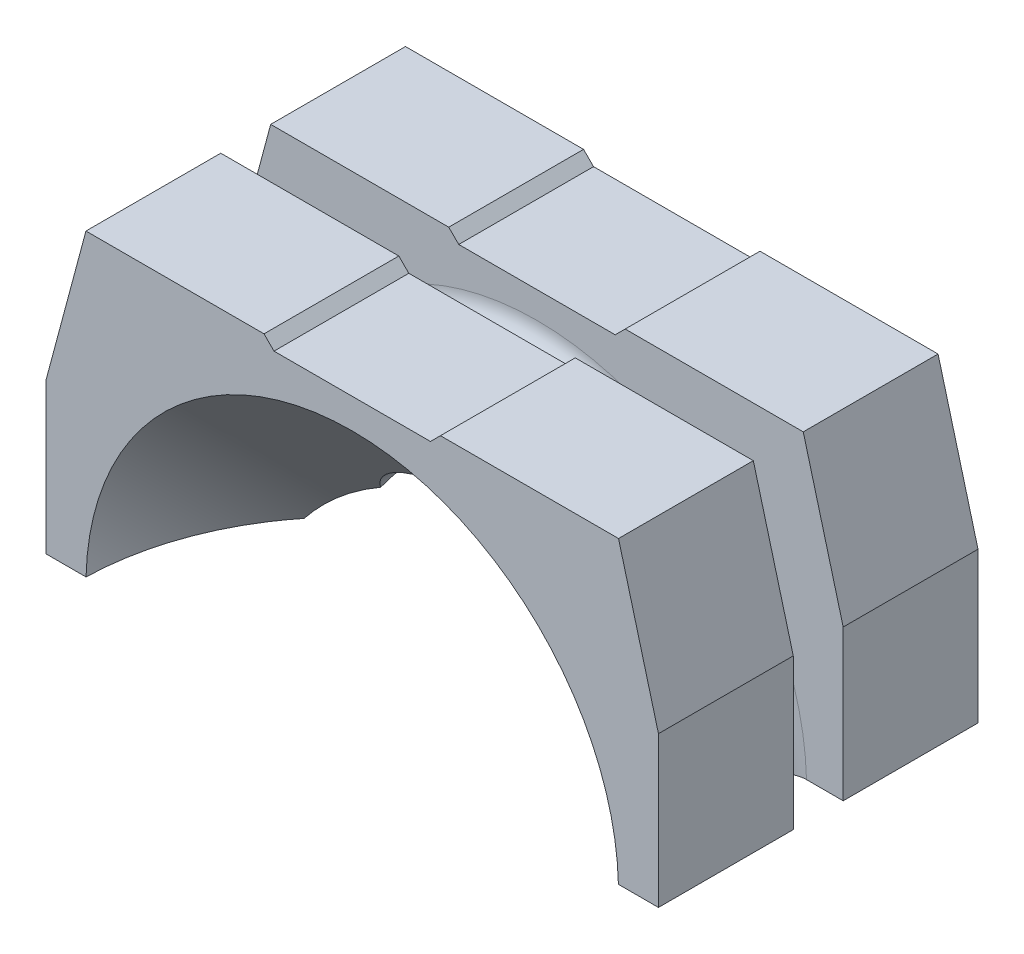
ISO-10303-21;
HEADER;
FILE_DESCRIPTION(('STEP AP214'),'2;1');
FILE_NAME('part.step','',(''),(''),'','','');
FILE_SCHEMA(('AUTOMOTIVE_DESIGN { 1 0 10303 214 1 1 1 1 }'));
ENDSEC;
DATA;
#1=APPLICATION_CONTEXT('core data for automotive mechanical design processes');
#2=APPLICATION_PROTOCOL_DEFINITION('international standard','automotive_design',2000,#1);
#3=PRODUCT_CONTEXT('',#1,'mechanical');
#4=PRODUCT('Part','Part','',(#3));
#5=PRODUCT_RELATED_PRODUCT_CATEGORY('part','',(#4));
#6=PRODUCT_DEFINITION_FORMATION('','',#4);
#7=PRODUCT_DEFINITION_CONTEXT('part definition',#1,'design');
#8=PRODUCT_DEFINITION('design','',#6,#7);
#9=PRODUCT_DEFINITION_SHAPE('','',#8);
#10=(LENGTH_UNIT() NAMED_UNIT(*) SI_UNIT(.MILLI.,.METRE.));
#11=(NAMED_UNIT(*) PLANE_ANGLE_UNIT() SI_UNIT($,.RADIAN.));
#12=(NAMED_UNIT(*) SI_UNIT($,.STERADIAN.) SOLID_ANGLE_UNIT());
#13=UNCERTAINTY_MEASURE_WITH_UNIT(LENGTH_MEASURE(1.E-05),#10,'distance_accuracy_value','');
#14=(GEOMETRIC_REPRESENTATION_CONTEXT(3) GLOBAL_UNCERTAINTY_ASSIGNED_CONTEXT((#13)) GLOBAL_UNIT_ASSIGNED_CONTEXT((#10,
#11,#12)) REPRESENTATION_CONTEXT('',''));
#15=CARTESIAN_POINT('',(0.,0.,0.));
#16=DIRECTION('',(0.,0.,1.));
#17=DIRECTION('',(1.,0.,0.));
#18=AXIS2_PLACEMENT_3D('',#15,#16,#17);
#19=CARTESIAN_POINT('',(-9.2,9.20000000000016,4.80000000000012));
#20=DIRECTION('',(0.,-1.00000000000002,0.));
#21=DIRECTION('',(0.,0.,-1.00000000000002));
#22=AXIS2_PLACEMENT_3D('',#19,#20,#21);
#23=PLANE('',#22);
#24=DIRECTION('',(-1.,0.,0.));
#25=VECTOR('',#24,1.);
#26=CARTESIAN_POINT('',(-9.2,9.20000000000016,-4.80000000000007));
#27=LINE('',#26,#25);
#28=CARTESIAN_POINT('',(8.,9.20000000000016,-4.80000000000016));
#29=VERTEX_POINT('',#28);
#30=CARTESIAN_POINT('',(2.65,9.20000000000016,-4.80000000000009));
#31=VERTEX_POINT('',#30);
#32=EDGE_CURVE('E206',#29,#31,#27,.T.);
#33=ORIENTED_EDGE('',*,*,#32,.T.);
#34=DIRECTION('',(0.,0.,1.00000000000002));
#35=VECTOR('',#34,1.);
#36=CARTESIAN_POINT('',(2.65,9.20000000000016,-4.80000000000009));
#37=LINE('',#36,#35);
#38=CARTESIAN_POINT('',(2.65,9.20000000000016,-0.750000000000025));
#39=VERTEX_POINT('',#38);
#40=EDGE_CURVE('E188',#31,#39,#37,.T.);
#41=ORIENTED_EDGE('',*,*,#40,.T.);
#42=DIRECTION('',(-1.,0.,0.));
#43=VECTOR('',#42,1.);
#44=CARTESIAN_POINT('',(-9.2,9.20000000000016,-0.750000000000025));
#45=LINE('',#44,#43);
#46=CARTESIAN_POINT('',(8.,9.20000000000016,-0.75000000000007));
#47=VERTEX_POINT('',#46);
#48=EDGE_CURVE('E366',#47,#39,#45,.T.);
#49=ORIENTED_EDGE('',*,*,#48,.F.);
#50=DIRECTION('',(0.,0.,-1.00000000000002));
#51=VECTOR('',#50,1.);
#52=CARTESIAN_POINT('',(8.,9.20000000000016,4.8));
#53=LINE('',#52,#51);
#54=EDGE_CURVE('E212',#47,#29,#53,.T.);
#55=ORIENTED_EDGE('',*,*,#54,.T.);
#56=EDGE_LOOP('',(#33,#41,#49,#55));
#57=FACE_BOUND('',#56,.T.);
#58=ADVANCED_FACE('F14',(#57),#23,.F.);
#59=DIRECTION('',(1.,0.,0.));
#60=VECTOR('',#59,1.);
#61=CARTESIAN_POINT('',(-9.2,9.20000000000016,0.750000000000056));
#62=LINE('',#61,#60);
#63=CARTESIAN_POINT('',(2.65,9.20000000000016,0.750000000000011));
#64=VERTEX_POINT('',#63);
#65=CARTESIAN_POINT('',(8.,9.20000000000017,0.750000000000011));
#66=VERTEX_POINT('',#65);
#67=EDGE_CURVE('E357',#64,#66,#62,.T.);
#68=ORIENTED_EDGE('',*,*,#67,.F.);
#69=DIRECTION('',(0.,0.,1.00000000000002));
#70=VECTOR('',#69,1.);
#71=CARTESIAN_POINT('',(2.64999999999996,9.20000000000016,4.8));
#72=LINE('',#71,#70);
#73=CARTESIAN_POINT('',(2.65,9.20000000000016,4.8));
#74=VERTEX_POINT('',#73);
#75=EDGE_CURVE('E9',#64,#74,#72,.T.);
#76=ORIENTED_EDGE('',*,*,#75,.T.);
#77=DIRECTION('',(-1.,0.,0.));
#78=VECTOR('',#77,1.);
#79=CARTESIAN_POINT('',(-9.2,9.20000000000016,4.80000000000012));
#80=LINE('',#79,#78);
#81=CARTESIAN_POINT('',(8.,9.20000000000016,4.8));
#82=VERTEX_POINT('',#81);
#83=EDGE_CURVE('E374',#82,#74,#80,.T.);
#84=ORIENTED_EDGE('',*,*,#83,.F.);
#85=DIRECTION('',(0.,0.,-1.00000000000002));
#86=VECTOR('',#85,1.);
#87=CARTESIAN_POINT('',(8.,9.20000000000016,4.8));
#88=LINE('',#87,#86);
#89=EDGE_CURVE('E247',#82,#66,#88,.T.);
#90=ORIENTED_EDGE('',*,*,#89,.T.);
#91=EDGE_LOOP('',(#68,#76,#84,#90));
#92=FACE_BOUND('',#91,.T.);
#93=ADVANCED_FACE('F473',(#92),#23,.F.);
#94=CARTESIAN_POINT('',(9.2,9.20000000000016,-4.80000000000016));
#95=DIRECTION('',(0.,0.,-1.00000000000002));
#96=DIRECTION('',(-1.,0.,0.));
#97=AXIS2_PLACEMENT_3D('',#94,#95,#96);
#98=PLANE('',#97);
#99=DIRECTION('',(0.707106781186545,0.707106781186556,0.));
#100=VECTOR('',#99,1.);
#101=CARTESIAN_POINT('',(2.65,9.20000000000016,-4.80000000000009));
#102=LINE('',#101,#100);
#103=CARTESIAN_POINT('',(2.35,8.90000000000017,-4.80000000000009));
#104=VERTEX_POINT('',#103);
#105=EDGE_CURVE('E192',#104,#31,#102,.T.);
#106=ORIENTED_EDGE('',*,*,#105,.T.);
#107=ORIENTED_EDGE('',*,*,#32,.F.);
#108=DIRECTION('',(-0.258819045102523,0.965925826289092,0.));
#109=VECTOR('',#108,1.);
#110=CARTESIAN_POINT('',(8.08038475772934,8.9000000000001,-4.80000000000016));
#111=LINE('',#110,#109);
#112=CARTESIAN_POINT('',(9.2,4.72153903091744,-4.80000000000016));
#113=VERTEX_POINT('',#112);
#114=EDGE_CURVE('E226',#29,#113,#111,.F.);
#115=ORIENTED_EDGE('',*,*,#114,.T.);
#116=DIRECTION('',(0.,1.00000000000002,0.));
#117=VECTOR('',#116,1.);
#118=CARTESIAN_POINT('',(9.2,-9.20000000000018,-4.80000000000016));
#119=LINE('',#118,#117);
#120=CARTESIAN_POINT('',(9.2,0.19999999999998,-4.80000000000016));
#121=VERTEX_POINT('',#120);
#122=EDGE_CURVE('E219',#121,#113,#119,.T.);
#123=ORIENTED_EDGE('',*,*,#122,.F.);
#124=DIRECTION('',(-1.,0.,0.));
#125=VECTOR('',#124,1.);
#126=CARTESIAN_POINT('',(-9.2,0.200000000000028,-4.80000000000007));
#127=LINE('',#126,#125);
#128=CARTESIAN_POINT('',(7.99749960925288,0.199999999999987,-4.80000000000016));
#129=VERTEX_POINT('',#128);
#130=EDGE_CURVE('E304',#121,#129,#127,.T.);
#131=ORIENTED_EDGE('',*,*,#130,.T.);
#132=CARTESIAN_POINT('',(0.,0.,-4.80000000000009));
#133=DIRECTION('',(0.,0.,1.00000000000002));
#134=DIRECTION('',(1.,0.,0.));
#135=AXIS2_PLACEMENT_3D('',#132,#133,#134);
#136=CIRCLE('',#135,8.);
#137=CARTESIAN_POINT('',(-7.99749960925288,0.200000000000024,-4.80000000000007));
#138=VERTEX_POINT('',#137);
#139=EDGE_CURVE('E428',#129,#138,#136,.T.);
#140=ORIENTED_EDGE('',*,*,#139,.T.);
#141=CARTESIAN_POINT('',(-9.2,0.200000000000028,-4.80000000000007));
#142=VERTEX_POINT('',#141);
#143=EDGE_CURVE('E303',#138,#142,#127,.T.);
#144=ORIENTED_EDGE('',*,*,#143,.T.);
#145=DIRECTION('',(0.,-1.00000000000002,0.));
#146=VECTOR('',#145,1.);
#147=CARTESIAN_POINT('',(-9.2,-9.20000000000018,-4.80000000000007));
#148=LINE('',#147,#146);
#149=CARTESIAN_POINT('',(-9.2,4.72153903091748,-4.80000000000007));
#150=VERTEX_POINT('',#149);
#151=EDGE_CURVE('E213',#150,#142,#148,.T.);
#152=ORIENTED_EDGE('',*,*,#151,.F.);
#153=DIRECTION('',(-0.25881904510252,-0.965925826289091,0.));
#154=VECTOR('',#153,1.);
#155=CARTESIAN_POINT('',(-6.84781847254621,13.5000000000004,-4.80000000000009));
#156=LINE('',#155,#154);
#157=CARTESIAN_POINT('',(-8.,9.20000000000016,-4.80000000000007));
#158=VERTEX_POINT('',#157);
#159=EDGE_CURVE('E229',#150,#158,#156,.F.);
#160=ORIENTED_EDGE('',*,*,#159,.T.);
#161=CARTESIAN_POINT('',(-2.65,9.20000000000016,-4.80000000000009));
#162=VERTEX_POINT('',#161);
#163=EDGE_CURVE('E214',#162,#158,#27,.T.);
#164=ORIENTED_EDGE('',*,*,#163,.F.);
#165=DIRECTION('',(0.707106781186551,-0.707106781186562,0.));
#166=VECTOR('',#165,1.);
#167=CARTESIAN_POINT('',(-2.65,9.20000000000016,-4.80000000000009));
#168=LINE('',#167,#166);
#169=CARTESIAN_POINT('',(-2.35,8.90000000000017,-4.80000000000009));
#170=VERTEX_POINT('',#169);
#171=EDGE_CURVE('E29',#162,#170,#168,.T.);
#172=ORIENTED_EDGE('',*,*,#171,.T.);
#173=DIRECTION('',(1.,0.,0.));
#174=VECTOR('',#173,1.);
#175=CARTESIAN_POINT('',(2.35,8.90000000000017,-4.80000000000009));
#176=LINE('',#175,#174);
#177=EDGE_CURVE('E201',#170,#104,#176,.T.);
#178=ORIENTED_EDGE('',*,*,#177,.T.);
#179=EDGE_LOOP('',(#106,#107,#115,#123,#131,#140,#144,#152,#160,#164,#172,#178));
#180=FACE_BOUND('',#179,.T.);
#181=ADVANCED_FACE('F205',(#180),#98,.T.);
#182=CARTESIAN_POINT('',(-9.2,0.200000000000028,4.80000000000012));
#183=DIRECTION('',(0.,-1.00000000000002,0.));
#184=DIRECTION('',(0.,0.,-1.00000000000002));
#185=AXIS2_PLACEMENT_3D('',#182,#183,#184);
#186=PLANE('',#185);
#187=ORIENTED_EDGE('',*,*,#143,.F.);
#188=CARTESIAN_POINT('',(-7.99749960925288,0.200000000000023,-4.80000000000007));
#189=CARTESIAN_POINT('',(-7.99197993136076,0.200000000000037,-4.57836984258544));
#190=CARTESIAN_POINT('',(-7.97720288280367,0.200000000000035,-4.35697447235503));
#191=CARTESIAN_POINT('',(-7.92933733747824,0.200000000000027,-3.91618499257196));
#192=CARTESIAN_POINT('',(-7.8962499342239,0.200000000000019,-3.69679076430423));
#193=CARTESIAN_POINT('',(-7.81196509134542,0.200000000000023,-3.26150236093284));
#194=CARTESIAN_POINT('',(-7.76076714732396,0.200000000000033,-3.04560828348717));
#195=CARTESIAN_POINT('',(-7.64062180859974,0.20000000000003,-2.61881583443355));
#196=CARTESIAN_POINT('',(-7.57167434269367,0.200000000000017,-2.40791748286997));
#197=CARTESIAN_POINT('',(-7.41650435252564,0.200000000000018,-1.992573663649));
#198=CARTESIAN_POINT('',(-7.33028170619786,0.200000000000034,-1.7881282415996));
#199=CARTESIAN_POINT('',(-7.14115751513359,0.200000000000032,-1.38710459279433));
#200=CARTESIAN_POINT('',(-7.03825627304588,0.200000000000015,-1.1905262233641));
#201=CARTESIAN_POINT('',(-6.82193574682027,0.200000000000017,-0.81602674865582));
#202=CARTESIAN_POINT('',(-6.70928092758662,0.200000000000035,-0.637663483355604));
#203=CARTESIAN_POINT('',(-6.47024219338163,0.200000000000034,-0.290392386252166));
#204=CARTESIAN_POINT('',(-6.34385865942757,0.200000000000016,-0.121484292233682));
#205=CARTESIAN_POINT('',(-6.07467628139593,0.200000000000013,0.210092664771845));
#206=CARTESIAN_POINT('',(-5.93153523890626,0.200000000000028,0.372483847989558));
#207=CARTESIAN_POINT('',(-5.63256074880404,0.200000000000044,0.685168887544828));
#208=CARTESIAN_POINT('',(-5.47672564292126,0.200000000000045,0.835461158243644));
#209=CARTESIAN_POINT('',(-5.31503326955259,0.200000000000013,0.97916560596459));
#210=B_SPLINE_CURVE_WITH_KNOTS('',3,(#188,#189,#190,#191,#192,#193,#194,#195,#196,#197,#198,
#199,#200,#201,#202,#203,#204,#205,#206,#207,#208,#209),.UNSPECIFIED.,.F.,.F.,(4,2,2,2,2,2,2,2,
2,2,4),(0.,0.664899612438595,1.32975952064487,1.9946379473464,2.65951904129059,3.32440483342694,
3.98927856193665,4.62150848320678,5.25372086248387,5.90242449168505,6.55121299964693),.UNSPECIFIED.);
#211=CARTESIAN_POINT('',(-6.24499799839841,0.200000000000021,0.));
#212=VERTEX_POINT('',#211);
#213=EDGE_CURVE('E295',#138,#212,#210,.T.);
#214=ORIENTED_EDGE('',*,*,#213,.T.);
#215=CARTESIAN_POINT('',(-7.99749960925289,0.200000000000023,4.80000000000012));
#216=CARTESIAN_POINT('',(-7.99197993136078,0.200000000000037,4.57836984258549));
#217=CARTESIAN_POINT('',(-7.97720288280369,0.200000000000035,4.35697447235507));
#218=CARTESIAN_POINT('',(-7.92933733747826,0.200000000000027,3.916184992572));
#219=CARTESIAN_POINT('',(-7.89624993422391,0.200000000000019,3.69679076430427));
#220=CARTESIAN_POINT('',(-7.81196509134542,0.200000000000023,3.26150236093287));
#221=CARTESIAN_POINT('',(-7.76076714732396,0.200000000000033,3.0456082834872));
#222=CARTESIAN_POINT('',(-7.64062180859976,0.20000000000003,2.61881583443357));
#223=CARTESIAN_POINT('',(-7.57167434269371,0.200000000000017,2.40791748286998));
#224=CARTESIAN_POINT('',(-7.41650435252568,0.200000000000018,1.99257366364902));
#225=CARTESIAN_POINT('',(-7.33028170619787,0.200000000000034,1.78812824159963));
#226=CARTESIAN_POINT('',(-7.14115751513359,0.200000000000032,1.38710459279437));
#227=CARTESIAN_POINT('',(-7.03825627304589,0.200000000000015,1.19052622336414));
#228=CARTESIAN_POINT('',(-6.82193574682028,0.200000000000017,0.816026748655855));
#229=CARTESIAN_POINT('',(-6.70928092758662,0.200000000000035,0.637663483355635));
#230=CARTESIAN_POINT('',(-6.47024219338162,0.200000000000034,0.290392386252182));
#231=CARTESIAN_POINT('',(-6.34385865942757,0.200000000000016,0.121484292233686));
#232=CARTESIAN_POINT('',(-6.07467628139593,0.200000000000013,-0.210092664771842));
#233=CARTESIAN_POINT('',(-5.93153523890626,0.200000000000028,-0.372483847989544));
#234=CARTESIAN_POINT('',(-5.63256074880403,0.200000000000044,-0.685168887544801));
#235=CARTESIAN_POINT('',(-5.47672564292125,0.200000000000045,-0.835461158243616));
#236=CARTESIAN_POINT('',(-5.31503326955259,0.200000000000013,-0.979165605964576));
#237=B_SPLINE_CURVE_WITH_KNOTS('',3,(#215,#216,#217,#218,#219,#220,#221,#222,#223,#224,#225,
#226,#227,#228,#229,#230,#231,#232,#233,#234,#235,#236),.UNSPECIFIED.,.F.,.F.,(4,2,2,2,2,2,2,2,
2,2,4),(0.,0.6648996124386,1.32975952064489,1.99463794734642,2.65951904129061,3.32440483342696,
3.98927856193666,4.62150848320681,5.25372086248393,5.9024244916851,6.55121299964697),.UNSPECIFIED.);
#238=CARTESIAN_POINT('',(-7.99749960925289,0.200000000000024,4.80000000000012));
#239=VERTEX_POINT('',#238);
#240=EDGE_CURVE('E269',#239,#212,#237,.T.);
#241=ORIENTED_EDGE('',*,*,#240,.F.);
#242=DIRECTION('',(-1.,0.,0.));
#243=VECTOR('',#242,1.);
#244=CARTESIAN_POINT('',(-9.2,0.200000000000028,4.80000000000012));
#245=LINE('',#244,#243);
#246=CARTESIAN_POINT('',(-9.2,0.200000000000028,4.80000000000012));
#247=VERTEX_POINT('',#246);
#248=EDGE_CURVE('E307',#239,#247,#245,.T.);
#249=ORIENTED_EDGE('',*,*,#248,.T.);
#250=DIRECTION('',(0.,0.,-1.00000000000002));
#251=VECTOR('',#250,1.);
#252=CARTESIAN_POINT('',(-9.2,0.200000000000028,4.80000000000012));
#253=LINE('',#252,#251);
#254=CARTESIAN_POINT('',(-9.2,0.200000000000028,0.750000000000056));
#255=VERTEX_POINT('',#254);
#256=EDGE_CURVE('E312',#247,#255,#253,.T.);
#257=ORIENTED_EDGE('',*,*,#256,.T.);
#258=DIRECTION('',(-1.,0.,0.));
#259=VECTOR('',#258,1.);
#260=CARTESIAN_POINT('',(14.2,0.19999999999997,0.749999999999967));
#261=LINE('',#260,#259);
#262=CARTESIAN_POINT('',(-8.09753048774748,0.200000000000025,0.750000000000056));
#263=VERTEX_POINT('',#262);
#264=EDGE_CURVE('E345',#263,#255,#261,.T.);
#265=ORIENTED_EDGE('',*,*,#264,.F.);
#266=CARTESIAN_POINT('',(-7.68077559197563,0.200000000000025,-0.623640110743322));
#267=CARTESIAN_POINT('',(-7.64573818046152,0.200000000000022,-0.600239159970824));
#268=CARTESIAN_POINT('',(-7.61265096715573,0.200000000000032,-0.573863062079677));
#269=CARTESIAN_POINT('',(-7.55134701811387,0.200000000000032,-0.515908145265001));
#270=CARTESIAN_POINT('',(-7.52313617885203,0.200000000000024,-0.484323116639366));
#271=CARTESIAN_POINT('',(-7.4724298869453,0.200000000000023,-0.416875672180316));
#272=CARTESIAN_POINT('',(-7.44993179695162,0.200000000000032,-0.381015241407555));
#273=CARTESIAN_POINT('',(-7.41128371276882,0.200000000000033,-0.306035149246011));
#274=CARTESIAN_POINT('',(-7.39513214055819,0.200000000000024,-0.266916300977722));
#275=CARTESIAN_POINT('',(-7.36962927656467,0.200000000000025,-0.186527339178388));
#276=CARTESIAN_POINT('',(-7.36027700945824,0.200000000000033,-0.145257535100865));
#277=CARTESIAN_POINT('',(-7.34863530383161,0.200000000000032,-0.0617319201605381));
#278=CARTESIAN_POINT('',(-7.34634613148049,0.200000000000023,-0.0194760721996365));
#279=CARTESIAN_POINT('',(-7.34889613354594,0.200000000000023,0.0648094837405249));
#280=CARTESIAN_POINT('',(-7.35373354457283,0.200000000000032,0.106839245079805));
#281=CARTESIAN_POINT('',(-7.37039583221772,0.200000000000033,0.189489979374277));
#282=CARTESIAN_POINT('',(-7.38222069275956,0.200000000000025,0.230110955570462));
#283=CARTESIAN_POINT('',(-7.41252172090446,0.200000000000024,0.308792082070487));
#284=CARTESIAN_POINT('',(-7.43099799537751,0.200000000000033,0.34685219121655));
#285=CARTESIAN_POINT('',(-7.47407648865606,0.200000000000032,0.41933128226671));
#286=CARTESIAN_POINT('',(-7.49867870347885,0.200000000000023,0.453750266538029));
#287=CARTESIAN_POINT('',(-7.55331699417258,0.200000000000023,0.51797953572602));
#288=CARTESIAN_POINT('',(-7.58335442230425,0.200000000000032,0.54778867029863));
#289=CARTESIAN_POINT('',(-7.64800599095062,0.200000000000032,0.601943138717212));
#290=CARTESIAN_POINT('',(-7.68262014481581,0.200000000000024,0.626288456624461));
#291=CARTESIAN_POINT('',(-7.75545531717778,0.200000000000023,0.668832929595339));
#292=CARTESIAN_POINT('',(-7.79367756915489,0.200000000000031,0.687029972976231));
#293=CARTESIAN_POINT('',(-7.8726340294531,0.200000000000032,0.716750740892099));
#294=CARTESIAN_POINT('',(-7.91336824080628,0.200000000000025,0.728274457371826));
#295=CARTESIAN_POINT('',(-7.99620381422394,0.200000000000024,0.74432414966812));
#296=CARTESIAN_POINT('',(-8.03830553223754,0.200000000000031,0.748848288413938));
#297=CARTESIAN_POINT('',(-8.12267099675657,0.200000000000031,0.750764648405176));
#298=CARTESIAN_POINT('',(-8.1649347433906,0.200000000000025,0.748156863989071));
#299=CARTESIAN_POINT('',(-8.24842761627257,0.200000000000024,0.735882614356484));
#300=CARTESIAN_POINT('',(-8.28965666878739,0.20000000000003,0.726215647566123));
#301=CARTESIAN_POINT('',(-8.36990630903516,0.20000000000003,0.700096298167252));
#302=CARTESIAN_POINT('',(-8.40892689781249,0.200000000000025,0.683643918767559));
#303=CARTESIAN_POINT('',(-8.48364652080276,0.200000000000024,0.644422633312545));
#304=CARTESIAN_POINT('',(-8.51934596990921,0.200000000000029,0.621654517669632));
#305=CARTESIAN_POINT('',(-8.58641450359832,0.20000000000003,0.570446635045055));
#306=CARTESIAN_POINT('',(-8.61778359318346,0.200000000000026,0.542006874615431));
#307=CARTESIAN_POINT('',(-8.6752926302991,0.200000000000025,0.480270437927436));
#308=CARTESIAN_POINT('',(-8.70143386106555,0.200000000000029,0.446974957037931));
#309=CARTESIAN_POINT('',(-8.74775371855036,0.200000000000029,0.376466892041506));
#310=CARTESIAN_POINT('',(-8.76793235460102,0.200000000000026,0.339254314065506));
#311=CARTESIAN_POINT('',(-8.80174879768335,0.200000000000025,0.26197883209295));
#312=CARTESIAN_POINT('',(-8.81538830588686,0.200000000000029,0.221916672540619));
#313=CARTESIAN_POINT('',(-8.83574651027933,0.200000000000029,0.140070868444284));
#314=CARTESIAN_POINT('',(-8.84246521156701,0.200000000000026,0.098287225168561));
#315=CARTESIAN_POINT('',(-8.84879017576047,0.200000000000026,0.014192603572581));
#316=CARTESIAN_POINT('',(-8.84839771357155,0.200000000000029,-0.028118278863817));
#317=CARTESIAN_POINT('',(-8.84051464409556,0.200000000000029,-0.112073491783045));
#318=CARTESIAN_POINT('',(-8.83302404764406,0.200000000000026,-0.153717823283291));
#319=CARTESIAN_POINT('',(-8.81115811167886,0.200000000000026,-0.235156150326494));
#320=CARTESIAN_POINT('',(-8.79678305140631,0.200000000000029,-0.274950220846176));
#321=CARTESIAN_POINT('',(-8.76155680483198,0.200000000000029,-0.351560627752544));
#322=CARTESIAN_POINT('',(-8.74070560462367,0.200000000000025,-0.388376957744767));
#323=CARTESIAN_POINT('',(-8.6931168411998,0.200000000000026,-0.45799124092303));
#324=CARTESIAN_POINT('',(-8.66637863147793,0.20000000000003,-0.490788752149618));
#325=CARTESIAN_POINT('',(-8.60777657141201,0.200000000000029,-0.551430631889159));
#326=CARTESIAN_POINT('',(-8.57591270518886,0.200000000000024,-0.579274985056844));
#327=CARTESIAN_POINT('',(-8.50795559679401,0.200000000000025,-0.629227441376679));
#328=CARTESIAN_POINT('',(-8.4718613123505,0.20000000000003,-0.651334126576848));
#329=CARTESIAN_POINT('',(-8.39647576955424,0.20000000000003,-0.689174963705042));
#330=CARTESIAN_POINT('',(-8.35718463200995,0.200000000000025,-0.70490935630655));
#331=CARTESIAN_POINT('',(-8.27651283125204,0.200000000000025,-0.729563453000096));
#332=CARTESIAN_POINT('',(-8.23513183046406,0.200000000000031,-0.738482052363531));
#333=CARTESIAN_POINT('',(-8.15144853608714,0.20000000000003,-0.749248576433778));
#334=CARTESIAN_POINT('',(-8.10914601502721,0.200000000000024,-0.751094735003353));
#335=CARTESIAN_POINT('',(-8.02480643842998,0.200000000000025,-0.74766076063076));
#336=CARTESIAN_POINT('',(-7.9827695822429,0.200000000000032,-0.742375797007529));
#337=CARTESIAN_POINT('',(-7.90021648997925,0.20000000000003,-0.724822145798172));
#338=CARTESIAN_POINT('',(-7.85969848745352,0.200000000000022,-0.712561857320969));
#339=CARTESIAN_POINT('',(-7.79602179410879,0.200000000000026,-0.687274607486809));
#340=CARTESIAN_POINT('',(-7.77204580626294,0.200000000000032,-0.676255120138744));
#341=CARTESIAN_POINT('',(-7.72538391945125,0.200000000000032,-0.651758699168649));
#342=CARTESIAN_POINT('',(-7.70269802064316,0.200000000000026,-0.638281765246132));
#343=CARTESIAN_POINT('',(-7.68077559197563,0.200000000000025,-0.623640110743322));
#344=B_SPLINE_CURVE_WITH_KNOTS('',3,(#266,#267,#268,#269,#270,#271,#272,#273,#274,#275,#276,
#277,#278,#279,#280,#281,#282,#283,#284,#285,#286,#287,#288,#289,#290,#291,#292,#293,#294,#295,
#296,#297,#298,#299,#300,#301,#302,#303,#304,#305,#306,#307,#308,#309,#310,#311,#312,#313,#314,
#315,#316,#317,#318,#319,#320,#321,#322,#323,#324,#325,#326,#327,#328,#329,#330,#331,#332,#333,
#334,#335,#336,#337,#338,#339,#340,#341,#342,#343),.UNSPECIFIED.,.T.,.F.,(4,2,2,2,2,2,2,2,2,2,2,
2,2,2,2,2,2,2,2,2,2,2,2,2,2,2,2,2,2,2,2,2,2,2,2,2,2,2,4),(0.,0.12630406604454,0.252759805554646,
0.379157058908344,0.505522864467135,0.631870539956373,0.758222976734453,0.884544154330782,
1.01086504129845,1.13718795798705,1.26351079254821,1.38986509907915,1.51621977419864,
1.64261780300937,1.76901598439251,1.8954473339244,2.02187878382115,2.14831921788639,
2.27475959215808,2.40118414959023,2.52760856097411,2.65400190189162,2.78039504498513,
2.906755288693,3.03311543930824,3.15945293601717,3.28579023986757,3.4121224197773,
3.53845487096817,3.66480120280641,3.79114792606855,3.91752584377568,4.04389898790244,
4.17029261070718,4.29671779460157,4.42322866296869,4.54958751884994,4.62861423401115,
4.70764095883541),.UNSPECIFIED.);
#345=CARTESIAN_POINT('',(-8.09753048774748,0.200000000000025,-0.750000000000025));
#346=VERTEX_POINT('',#345);
#347=EDGE_CURVE('E339',#346,#263,#344,.T.);
#348=ORIENTED_EDGE('',*,*,#347,.F.);
#349=DIRECTION('',(1.,0.,0.));
#350=VECTOR('',#349,1.);
#351=CARTESIAN_POINT('',(8.1,0.199999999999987,-0.75000000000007));
#352=LINE('',#351,#350);
#353=CARTESIAN_POINT('',(-9.2,0.200000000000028,-0.750000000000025));
#354=VERTEX_POINT('',#353);
#355=EDGE_CURVE('E351',#354,#346,#352,.T.);
#356=ORIENTED_EDGE('',*,*,#355,.F.);
#357=EDGE_CURVE('E311',#354,#142,#253,.T.);
#358=ORIENTED_EDGE('',*,*,#357,.T.);
#359=EDGE_LOOP('',(#187,#214,#241,#249,#257,#265,#348,#356,#358));
#360=FACE_BOUND('',#359,.T.);
#361=ADVANCED_FACE('F275',(#360),#186,.T.);
#362=CARTESIAN_POINT('',(5.31503326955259,0.199999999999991,-0.979165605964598));
#363=CARTESIAN_POINT('',(5.48074520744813,0.200000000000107,-0.831890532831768));
#364=CARTESIAN_POINT('',(5.64030231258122,0.200000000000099,-0.677696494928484));
#365=CARTESIAN_POINT('',(5.94606822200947,0.200000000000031,-0.356614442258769));
#366=CARTESIAN_POINT('',(6.09227782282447,0.19999999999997,-0.189727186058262));
#367=CARTESIAN_POINT('',(6.37033399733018,0.199999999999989,0.15562001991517));
#368=CARTESIAN_POINT('',(6.5021801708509,0.20000000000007,0.334080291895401));
#369=CARTESIAN_POINT('',(6.75059990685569,0.200000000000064,0.701332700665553));
#370=CARTESIAN_POINT('',(6.86717340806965,0.199999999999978,0.890124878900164));
#371=CARTESIAN_POINT('',(7.08424106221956,0.19999999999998,1.27673818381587));
#372=CARTESIAN_POINT('',(7.18473510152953,0.20000000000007,1.47455937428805));
#373=CARTESIAN_POINT('',(7.36894843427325,0.200000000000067,1.87786245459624));
#374=CARTESIAN_POINT('',(7.4526680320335,0.199999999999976,2.08334420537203));
#375=CARTESIAN_POINT('',(7.59906808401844,0.19999999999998,2.49029807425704));
#376=CARTESIAN_POINT('',(7.66257969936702,0.200000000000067,2.69147172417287));
#377=CARTESIAN_POINT('',(7.77351919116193,0.200000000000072,3.09820156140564));
#378=CARTESIAN_POINT('',(7.82094751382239,0.199999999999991,3.30375762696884));
#379=CARTESIAN_POINT('',(7.90044294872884,0.19999999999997,3.72337996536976));
#380=CARTESIAN_POINT('',(7.93207709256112,0.200000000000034,3.93752836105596));
#381=CARTESIAN_POINT('',(7.97791300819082,0.200000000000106,4.36771058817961));
#382=CARTESIAN_POINT('',(7.9921124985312,0.200000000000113,4.58374466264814));
#383=CARTESIAN_POINT('',(7.99749960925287,0.199999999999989,4.8));
#384=B_SPLINE_CURVE_WITH_KNOTS('',3,(#362,#363,#364,#365,#366,#367,#368,#369,#370,#371,#372,
#373,#374,#375,#376,#377,#378,#379,#380,#381,#382,#383),.UNSPECIFIED.,.F.,.F.,(4,2,2,2,2,2,2,2,
2,2,4),(0.,0.664899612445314,1.32975952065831,1.99463794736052,2.6595190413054,3.3244048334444,
3.98927856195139,4.62150848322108,5.25372086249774,5.90242449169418,6.55121299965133),.UNSPECIFIED.);
#385=CARTESIAN_POINT('',(6.24499799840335,0.19999999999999,6.16954404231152E-12));
#386=VERTEX_POINT('',#385);
#387=CARTESIAN_POINT('',(7.99749960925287,0.199999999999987,4.8));
#388=VERTEX_POINT('',#387);
#389=EDGE_CURVE('E261',#386,#388,#384,.T.);
#390=ORIENTED_EDGE('',*,*,#389,.F.);
#391=CARTESIAN_POINT('',(5.31503326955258,0.199999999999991,0.979165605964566));
#392=CARTESIAN_POINT('',(5.4807452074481,0.200000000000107,0.831890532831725));
#393=CARTESIAN_POINT('',(5.6403023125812,0.200000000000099,0.677696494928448));
#394=CARTESIAN_POINT('',(5.94606822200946,0.200000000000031,0.356614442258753));
#395=CARTESIAN_POINT('',(6.09227782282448,0.19999999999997,0.189727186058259));
#396=CARTESIAN_POINT('',(6.37033399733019,0.199999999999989,-0.155620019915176));
#397=CARTESIAN_POINT('',(6.5021801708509,0.20000000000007,-0.334080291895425));
#398=CARTESIAN_POINT('',(6.75059990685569,0.200000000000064,-0.701332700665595));
#399=CARTESIAN_POINT('',(6.86717340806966,0.199999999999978,-0.890124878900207));
#400=CARTESIAN_POINT('',(7.08424106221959,0.19999999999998,-1.27673818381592));
#401=CARTESIAN_POINT('',(7.18473510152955,0.20000000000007,-1.47455937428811));
#402=CARTESIAN_POINT('',(7.36894843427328,0.200000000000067,-1.8778624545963));
#403=CARTESIAN_POINT('',(7.45266803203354,0.199999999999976,-2.0833442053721));
#404=CARTESIAN_POINT('',(7.59906808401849,0.19999999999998,-2.49029807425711));
#405=CARTESIAN_POINT('',(7.66257969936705,0.200000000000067,-2.69147172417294));
#406=CARTESIAN_POINT('',(7.77351919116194,0.200000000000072,-3.09820156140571));
#407=CARTESIAN_POINT('',(7.8209475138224,0.199999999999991,-3.30375762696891));
#408=CARTESIAN_POINT('',(7.90044294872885,0.19999999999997,-3.72337996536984));
#409=CARTESIAN_POINT('',(7.93207709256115,0.200000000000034,-3.93752836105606));
#410=CARTESIAN_POINT('',(7.97791300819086,0.200000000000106,-4.36771058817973));
#411=CARTESIAN_POINT('',(7.99211249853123,0.200000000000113,-4.58374466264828));
#412=CARTESIAN_POINT('',(7.99749960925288,0.199999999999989,-4.80000000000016));
#413=B_SPLINE_CURVE_WITH_KNOTS('',3,(#391,#392,#393,#394,#395,#396,#397,#398,#399,#400,#401,
#402,#403,#404,#405,#406,#407,#408,#409,#410,#411,#412),.UNSPECIFIED.,.F.,.F.,(4,2,2,2,2,2,2,2,
2,2,4),(0.,0.664899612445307,1.3297595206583,1.99463794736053,2.65951904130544,3.32440483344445,
3.98927856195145,4.62150848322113,5.25372086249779,5.90242449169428,6.55121299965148),.UNSPECIFIED.);
#414=EDGE_CURVE('E731',#386,#129,#413,.T.);
#415=ORIENTED_EDGE('',*,*,#414,.T.);
#416=ORIENTED_EDGE('',*,*,#130,.F.);
#417=DIRECTION('',(0.,0.,-1.00000000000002));
#418=VECTOR('',#417,1.);
#419=CARTESIAN_POINT('',(9.2,0.19999999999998,4.8));
#420=LINE('',#419,#418);
#421=CARTESIAN_POINT('',(9.2,0.19999999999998,-0.75000000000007));
#422=VERTEX_POINT('',#421);
#423=EDGE_CURVE('E314',#422,#121,#420,.T.);
#424=ORIENTED_EDGE('',*,*,#423,.F.);
#425=CARTESIAN_POINT('',(8.09753048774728,0.199999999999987,-0.750000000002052));
#426=VERTEX_POINT('',#425);
#427=EDGE_CURVE('E346',#426,#422,#352,.T.);
#428=ORIENTED_EDGE('',*,*,#427,.F.);
#429=CARTESIAN_POINT('',(7.42529714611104,0.199999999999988,-0.333020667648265));
#430=CARTESIAN_POINT('',(7.44401256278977,0.199999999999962,-0.370769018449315));
#431=CARTESIAN_POINT('',(7.46593033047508,0.200000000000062,-0.406964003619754));
#432=CARTESIAN_POINT('',(7.51555101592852,0.200000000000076,-0.475189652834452));
#433=CARTESIAN_POINT('',(7.54326089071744,0.19999999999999,-0.507215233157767));
#434=CARTESIAN_POINT('',(7.6036534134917,0.199999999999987,-0.566146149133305));
#435=CARTESIAN_POINT('',(7.63633360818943,0.20000000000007,-0.593053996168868));
#436=CARTESIAN_POINT('',(7.70573784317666,0.200000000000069,-0.640995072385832));
#437=CARTESIAN_POINT('',(7.74246087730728,0.199999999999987,-0.662029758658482));
#438=CARTESIAN_POINT('',(7.81892935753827,0.199999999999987,-0.697645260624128));
#439=CARTESIAN_POINT('',(7.8586758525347,0.200000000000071,-0.71222382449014));
#440=CARTESIAN_POINT('',(7.94005347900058,0.200000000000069,-0.734503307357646));
#441=CARTESIAN_POINT('',(7.98168468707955,0.199999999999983,-0.742203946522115));
#442=CARTESIAN_POINT('',(8.06565735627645,0.199999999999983,-0.75050920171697));
#443=CARTESIAN_POINT('',(8.10799895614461,0.200000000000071,-0.751112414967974));
#444=CARTESIAN_POINT('',(8.19218240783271,0.20000000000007,-0.745201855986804));
#445=CARTESIAN_POINT('',(8.23402426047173,0.199999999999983,-0.738688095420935));
#446=CARTESIAN_POINT('',(8.31602106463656,0.199999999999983,-0.718727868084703));
#447=CARTESIAN_POINT('',(8.35617599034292,0.200000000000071,-0.705281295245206));
#448=CARTESIAN_POINT('',(8.43365777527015,0.200000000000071,-0.671836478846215));
#449=CARTESIAN_POINT('',(8.47098464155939,0.199999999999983,-0.651838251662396));
#450=CARTESIAN_POINT('',(8.54174392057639,0.199999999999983,-0.605861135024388));
#451=CARTESIAN_POINT('',(8.57517698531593,0.200000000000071,-0.579883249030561));
#452=CARTESIAN_POINT('',(8.6372058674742,0.200000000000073,-0.522681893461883));
#453=CARTESIAN_POINT('',(8.6658016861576,0.199999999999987,-0.491458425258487));
#454=CARTESIAN_POINT('',(8.71733631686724,0.199999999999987,-0.42466097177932));
#455=CARTESIAN_POINT('',(8.74027660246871,0.200000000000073,-0.389088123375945));
#456=CARTESIAN_POINT('',(8.77985766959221,0.200000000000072,-0.314595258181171));
#457=CARTESIAN_POINT('',(8.79649846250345,0.199999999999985,-0.275675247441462));
#458=CARTESIAN_POINT('',(8.82300405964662,0.199999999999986,-0.195603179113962));
#459=CARTESIAN_POINT('',(8.83287053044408,0.200000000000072,-0.154451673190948));
#460=CARTESIAN_POINT('',(8.84555356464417,0.200000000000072,-0.0710762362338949));
#461=CARTESIAN_POINT('',(8.84837013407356,0.199999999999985,-0.0288523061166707));
#462=CARTESIAN_POINT('',(8.84687339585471,0.199999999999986,0.0554628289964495));
#463=CARTESIAN_POINT('',(8.84256112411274,0.200000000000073,0.097554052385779));
#464=CARTESIAN_POINT('',(8.82693126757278,0.200000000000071,0.18041508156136));
#465=CARTESIAN_POINT('',(8.81561368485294,0.199999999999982,0.221184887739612));
#466=CARTESIAN_POINT('',(8.78629485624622,0.199999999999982,0.300246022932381));
#467=CARTESIAN_POINT('',(8.7682935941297,0.200000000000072,0.338537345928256));
#468=CARTESIAN_POINT('',(8.72611892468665,0.200000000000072,0.411554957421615));
#469=CARTESIAN_POINT('',(8.7019455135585,0.199999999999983,0.446281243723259));
#470=CARTESIAN_POINT('',(8.64810913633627,0.199999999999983,0.511188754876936));
#471=CARTESIAN_POINT('',(8.61844535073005,0.200000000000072,0.541369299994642));
#472=CARTESIAN_POINT('',(8.5544730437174,0.200000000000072,0.596323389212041));
#473=CARTESIAN_POINT('',(8.52016451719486,0.199999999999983,0.621096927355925));
#474=CARTESIAN_POINT('',(8.44786758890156,0.199999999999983,0.664540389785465));
#475=CARTESIAN_POINT('',(8.40987827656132,0.20000000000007,0.683208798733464));
#476=CARTESIAN_POINT('',(8.33130524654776,0.200000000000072,0.713904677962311));
#477=CARTESIAN_POINT('',(8.29072152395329,0.199999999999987,0.725932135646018));
#478=CARTESIAN_POINT('',(8.20810044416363,0.199999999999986,0.743007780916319));
#479=CARTESIAN_POINT('',(8.16606271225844,0.20000000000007,0.748054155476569));
#480=CARTESIAN_POINT('',(8.0817366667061,0.200000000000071,0.751019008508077));
#481=CARTESIAN_POINT('',(8.03944835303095,0.199999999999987,0.748937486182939));
#482=CARTESIAN_POINT('',(7.95581424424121,0.199999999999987,0.737704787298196));
#483=CARTESIAN_POINT('',(7.9144686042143,0.20000000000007,0.728552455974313));
#484=CARTESIAN_POINT('',(7.83390064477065,0.20000000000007,0.703436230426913));
#485=CARTESIAN_POINT('',(7.79467832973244,0.199999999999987,0.687472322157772));
#486=CARTESIAN_POINT('',(7.7194717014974,0.199999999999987,0.649185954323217));
#487=CARTESIAN_POINT('',(7.6834873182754,0.20000000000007,0.626863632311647));
#488=CARTESIAN_POINT('',(7.6157778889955,0.200000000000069,0.576493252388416));
#489=CARTESIAN_POINT('',(7.58405284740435,0.199999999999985,0.548445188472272));
#490=CARTESIAN_POINT('',(7.52577004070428,0.199999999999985,0.487425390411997));
#491=CARTESIAN_POINT('',(7.4992112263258,0.200000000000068,0.454454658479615));
#492=CARTESIAN_POINT('',(7.45200918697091,0.20000000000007,0.384522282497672));
#493=CARTESIAN_POINT('',(7.43136571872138,0.199999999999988,0.347560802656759));
#494=CARTESIAN_POINT('',(7.39658806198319,0.199999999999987,0.270712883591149));
#495=CARTESIAN_POINT('',(7.38245098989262,0.200000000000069,0.230827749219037));
#496=CARTESIAN_POINT('',(7.36107273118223,0.200000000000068,0.149238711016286));
#497=CARTESIAN_POINT('',(7.35383324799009,0.199999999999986,0.107534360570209));
#498=CARTESIAN_POINT('',(7.34645982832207,0.199999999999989,0.023498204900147));
#499=CARTESIAN_POINT('',(7.34632723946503,0.200000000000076,-0.0188337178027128));
#500=CARTESIAN_POINT('',(7.35317784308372,0.200000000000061,-0.102882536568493));
#501=CARTESIAN_POINT('',(7.36015246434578,0.19999999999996,-0.144600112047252));
#502=CARTESIAN_POINT('',(7.37706733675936,0.200000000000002,-0.210887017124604));
#503=CARTESIAN_POINT('',(7.38490931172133,0.200000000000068,-0.236011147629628));
#504=CARTESIAN_POINT('',(7.40318414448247,0.200000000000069,-0.285298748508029));
#505=CARTESIAN_POINT('',(7.41361700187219,0.200000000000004,-0.309462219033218));
#506=CARTESIAN_POINT('',(7.42529714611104,0.199999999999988,-0.333020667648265));
#507=B_SPLINE_CURVE_WITH_KNOTS('',3,(#429,#430,#431,#432,#433,#434,#435,#436,#437,#438,#439,
#440,#441,#442,#443,#444,#445,#446,#447,#448,#449,#450,#451,#452,#453,#454,#455,#456,#457,#458,
#459,#460,#461,#462,#463,#464,#465,#466,#467,#468,#469,#470,#471,#472,#473,#474,#475,#476,#477,
#478,#479,#480,#481,#482,#483,#484,#485,#486,#487,#488,#489,#490,#491,#492,#493,#494,#495,#496,
#497,#498,#499,#500,#501,#502,#503,#504,#505,#506),.UNSPECIFIED.,.T.,.F.,(4,2,2,2,2,2,2,2,2,2,2,
2,2,2,2,2,2,2,2,2,2,2,2,2,2,2,2,2,2,2,2,2,2,2,2,2,2,2,4),(0.,0.126303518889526,
0.252759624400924,0.379153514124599,0.505516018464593,0.631922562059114,0.758334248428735,
0.884770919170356,1.01120738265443,1.137645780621,1.26408386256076,1.39050074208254,
1.51691758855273,1.64330146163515,1.7696851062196,1.89603764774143,2.02239008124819,
2.14872415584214,2.27505819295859,2.40139253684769,2.52772695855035,2.65408025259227,
2.78043368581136,2.90681845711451,3.03320346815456,3.15962129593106,3.28603913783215,
3.41247762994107,3.53891638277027,3.66535240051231,3.7917885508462,3.91819899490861,
4.04460423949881,4.17095340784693,4.29733377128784,4.42373809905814,4.54999016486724,
4.62881520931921,4.70764024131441),.UNSPECIFIED.);
#508=CARTESIAN_POINT('',(8.09753048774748,0.199999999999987,0.750000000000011));
#509=VERTEX_POINT('',#508);
#510=EDGE_CURVE('E318',#509,#426,#507,.T.);
#511=ORIENTED_EDGE('',*,*,#510,.F.);
#512=CARTESIAN_POINT('',(9.2,0.19999999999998,0.750000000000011));
#513=VERTEX_POINT('',#512);
#514=EDGE_CURVE('E325',#513,#509,#261,.T.);
#515=ORIENTED_EDGE('',*,*,#514,.F.);
#516=CARTESIAN_POINT('',(9.2,0.19999999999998,4.8));
#517=VERTEX_POINT('',#516);
#518=EDGE_CURVE('E315',#517,#513,#420,.T.);
#519=ORIENTED_EDGE('',*,*,#518,.F.);
#520=EDGE_CURVE('E308',#517,#388,#245,.T.);
#521=ORIENTED_EDGE('',*,*,#520,.T.);
#522=EDGE_LOOP('',(#390,#415,#416,#424,#428,#511,#515,#519,#521));
#523=FACE_BOUND('',#522,.T.);
#524=ADVANCED_FACE('F284',(#523),#186,.T.);
#525=CARTESIAN_POINT('',(0.,-5.77916560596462,-0.979165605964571));
#526=DIRECTION('',(0.,0.,1.00000000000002));
#527=DIRECTION('',(1.,0.,0.));
#528=AXIS2_PLACEMENT_3D('',#525,#526,#527);
#529=CIRCLE('',#528,8.);
#530=DIRECTION('',(0.,0.707106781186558,0.70710678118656));
#531=VECTOR('',#530,1.);
#532=SURFACE_OF_LINEAR_EXTRUSION('',#529,#531);
#533=CARTESIAN_POINT('',(7.99983343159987,-4.74837571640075,0.));
#534=CARTESIAN_POINT('',(7.99842560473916,-4.52668310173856,0.));
#535=CARTESIAN_POINT('',(7.98775780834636,-4.30505354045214,0.));
#536=CARTESIAN_POINT('',(7.94807677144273,-3.86345204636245,0.));
#537=CARTESIAN_POINT('',(7.9190643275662,-3.64348004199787,0.));
#538=CARTESIAN_POINT('',(7.84286728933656,-3.20669965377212,0.));
#539=CARTESIAN_POINT('',(7.79568219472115,-2.98989135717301,0.));
#540=CARTESIAN_POINT('',(7.68347364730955,-2.56094398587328,0.));
#541=CARTESIAN_POINT('',(7.61845040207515,-2.34880485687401,0.));
#542=CARTESIAN_POINT('',(7.47102535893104,-1.93069504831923,0.));
#543=CARTESIAN_POINT('',(7.38862658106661,-1.72472330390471,0.));
#544=CARTESIAN_POINT('',(7.20698049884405,-1.32025923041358,0.));
#545=CARTESIAN_POINT('',(7.10772715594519,-1.12176961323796,0.));
#546=CARTESIAN_POINT('',(6.89309828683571,-0.733755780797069,0.));
#547=CARTESIAN_POINT('',(6.7777257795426,-0.544229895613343,0.));
#548=CARTESIAN_POINT('',(6.53163957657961,-0.175410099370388,0.));
#549=CARTESIAN_POINT('',(6.40092564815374,0.0038836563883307,0.));
#550=CARTESIAN_POINT('',(6.12506352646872,0.350994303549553,0.));
#551=CARTESIAN_POINT('',(5.97991560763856,0.518811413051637,0.));
#552=CARTESIAN_POINT('',(5.67618248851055,0.841817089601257,0.));
#553=CARTESIAN_POINT('',(5.51759698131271,0.997005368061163,0.));
#554=CARTESIAN_POINT('',(5.18811663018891,1.29365046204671,0.));
#555=CARTESIAN_POINT('',(5.01722400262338,1.43510973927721,0.));
#556=CARTESIAN_POINT('',(4.6642247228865,1.70339686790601,0.));
#557=CARTESIAN_POINT('',(4.48211431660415,1.83021977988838,0.));
#558=CARTESIAN_POINT('',(4.10805486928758,2.06826137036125,0.));
#559=CARTESIAN_POINT('',(3.91610926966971,2.17948545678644,0.));
#560=CARTESIAN_POINT('',(3.52357602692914,2.38565071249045,0.));
#561=CARTESIAN_POINT('',(3.32298530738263,2.48058602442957,0.));
#562=CARTESIAN_POINT('',(2.91465098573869,2.6534525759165,0.));
#563=CARTESIAN_POINT('',(2.70690874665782,2.7313870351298,0.));
#564=CARTESIAN_POINT('',(2.28566593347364,2.86973785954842,0.));
#565=CARTESIAN_POINT('',(2.07216524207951,2.93015386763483,0.));
#566=CARTESIAN_POINT('',(1.64088887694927,3.03304725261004,0.));
#567=CARTESIAN_POINT('',(1.42311329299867,3.07552500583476,0.));
#568=CARTESIAN_POINT('',(0.984782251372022,3.1422510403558,0.));
#569=CARTESIAN_POINT('',(0.764226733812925,3.16649892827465,0.));
#570=CARTESIAN_POINT('',(0.321866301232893,3.19659606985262,0.));
#571=CARTESIAN_POINT('',(0.10006139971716,3.20244552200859,0.));
#572=CARTESIAN_POINT('',(-0.343268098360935,3.19570594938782,0.));
#573=CARTESIAN_POINT('',(-0.564792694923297,3.18311692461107,0.));
#574=CARTESIAN_POINT('',(-1.00603383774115,3.13958711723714,0.));
#575=CARTESIAN_POINT('',(-1.22575036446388,3.10864613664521,0.));
#576=CARTESIAN_POINT('',(-1.66185055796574,3.02862684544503,0.));
#577=CARTESIAN_POINT('',(-1.87823429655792,2.97954892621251,0.));
#578=CARTESIAN_POINT('',(-2.30618368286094,2.86359344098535,0.));
#579=CARTESIAN_POINT('',(-2.51774922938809,2.7967155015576,0.));
#580=CARTESIAN_POINT('',(-2.93459188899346,2.64562395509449,0.));
#581=CARTESIAN_POINT('',(-3.13986913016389,2.56141070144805,0.));
#582=CARTESIAN_POINT('',(-3.54276007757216,2.3762117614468,0.));
#583=CARTESIAN_POINT('',(-3.7403723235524,2.27522289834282,0.));
#584=CARTESIAN_POINT('',(-4.12645730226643,2.05722095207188,0.));
#585=CARTESIAN_POINT('',(-4.31493328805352,1.94021363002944,0.));
#586=CARTESIAN_POINT('',(-4.68158405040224,1.69091163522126,0.));
#587=CARTESIAN_POINT('',(-4.85975522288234,1.55861166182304,0.));
#588=CARTESIAN_POINT('',(-5.20443616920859,1.27971827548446,0.));
#589=CARTESIAN_POINT('',(-5.37094984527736,1.1331296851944,0.));
#590=CARTESIAN_POINT('',(-5.69126091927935,0.826606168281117,0.));
#591=CARTESIAN_POINT('',(-5.84505601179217,0.666668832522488,0.));
#592=CARTESIAN_POINT('',(-6.13883023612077,0.33457969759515,0.));
#593=CARTESIAN_POINT('',(-6.27880971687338,0.162428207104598,0.));
#594=CARTESIAN_POINT('',(-6.54399305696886,-0.192907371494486,0.));
#595=CARTESIAN_POINT('',(-6.66919660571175,-0.376091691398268,0.));
#596=CARTESIAN_POINT('',(-6.90395798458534,-0.752221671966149,0.));
#597=CARTESIAN_POINT('',(-7.01351607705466,-0.945167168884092,0.));
#598=CARTESIAN_POINT('',(-7.21625275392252,-1.33952839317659,0.));
#599=CARTESIAN_POINT('',(-7.30942795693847,-1.54094585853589,0.));
#600=CARTESIAN_POINT('',(-7.47869560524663,-1.95074819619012,0.));
#601=CARTESIAN_POINT('',(-7.55479479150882,-2.15913028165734,0.));
#602=CARTESIAN_POINT('',(-7.68258659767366,-2.56001795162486,0.));
#603=CARTESIAN_POINT('',(-7.73597331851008,-2.75198575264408,0.));
#604=CARTESIAN_POINT('',(-7.82827674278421,-3.13935950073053,0.));
#605=CARTESIAN_POINT('',(-7.8671944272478,-3.33476521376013,0.));
#606=CARTESIAN_POINT('',(-7.93107234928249,-3.73249174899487,0.));
#607=CARTESIAN_POINT('',(-7.95568838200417,-3.9348679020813,0.));
#608=CARTESIAN_POINT('',(-7.98942084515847,-4.34093734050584,0.));
#609=CARTESIAN_POINT('',(-7.99853500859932,-4.54463081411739,0.));
#610=CARTESIAN_POINT('',(-7.99983343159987,-4.74837571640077,0.));
#611=B_SPLINE_CURVE_WITH_KNOTS('',3,(#533,#534,#535,#536,#537,#538,#539,#540,#541,#542,#543,
#544,#545,#546,#547,#548,#549,#550,#551,#552,#553,#554,#555,#556,#557,#558,#559,#560,#561,#562,
#563,#564,#565,#566,#567,#568,#569,#570,#571,#572,#573,#574,#575,#576,#577,#578,#579,#580,#581,
#582,#583,#584,#585,#586,#587,#588,#589,#590,#591,#592,#593,#594,#595,#596,#597,#598,#599,#600,
#601,#602,#603,#604,#605,#606,#607,#608,#609,#610),.UNSPECIFIED.,.F.,.F.,(4,2,2,2,2,2,2,2,2,2,2,
2,2,2,2,2,2,2,2,2,2,2,2,2,2,2,2,2,2,2,2,2,2,2,2,2,2,2,4),(0.,0.664894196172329,1.3297595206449,
1.99464314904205,2.65951904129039,3.32427946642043,3.98927856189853,4.65415327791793,
5.31903808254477,5.98391024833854,6.6487976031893,7.31356551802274,7.97855712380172,
8.64331761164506,9.3083166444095,9.97318962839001,10.6380761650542,11.3029487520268,
11.9678356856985,12.6327154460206,13.2975952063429,13.9624821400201,14.6273547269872,
15.2922412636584,15.9571142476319,16.6221132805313,17.2868737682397,17.9518653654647,
18.6166332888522,19.2815214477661,19.9463928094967,20.6112781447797,21.2761523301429,
21.941163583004,22.6059118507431,23.2031267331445,23.8003011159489,24.4113089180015,
25.0224060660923),.UNSPECIFIED.);
#612=CARTESIAN_POINT('',(-3.9491888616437,2.15729166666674,0.));
#613=VERTEX_POINT('',#612);
#614=EDGE_CURVE('E726',#613,#212,#611,.T.);
#615=ORIENTED_EDGE('',*,*,#614,.F.);
#616=CARTESIAN_POINT('',(-3.94918886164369,2.15729166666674,0.));
#617=CARTESIAN_POINT('',(-3.89580772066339,2.25504602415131,0.0674659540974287));
#618=CARTESIAN_POINT('',(-3.83805662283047,2.35210667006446,0.132545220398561));
#619=CARTESIAN_POINT('',(-3.71373570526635,2.54385417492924,0.257727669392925));
#620=CARTESIAN_POINT('',(-3.64716080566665,2.63853962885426,0.31782795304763));
#621=CARTESIAN_POINT('',(-3.50500623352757,2.82465602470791,0.432907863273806));
#622=CARTESIAN_POINT('',(-3.42940551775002,2.91607868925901,0.487874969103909));
#623=CARTESIAN_POINT('',(-3.26951203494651,3.09428765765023,0.592367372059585));
#624=CARTESIAN_POINT('',(-3.18522107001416,3.18107491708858,0.641893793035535));
#625=CARTESIAN_POINT('',(-3.00791241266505,3.34924650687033,0.735627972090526));
#626=CARTESIAN_POINT('',(-2.91486090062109,3.43060763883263,0.779813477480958));
#627=CARTESIAN_POINT('',(-2.72084217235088,3.58643239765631,0.862619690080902));
#628=CARTESIAN_POINT('',(-2.6198753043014,3.66089632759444,0.901240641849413));
#629=CARTESIAN_POINT('',(-2.41086745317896,3.80178598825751,0.972905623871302));
#630=CARTESIAN_POINT('',(-2.30283798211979,3.86822432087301,1.00595843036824));
#631=CARTESIAN_POINT('',(-2.08038120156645,3.99227118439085,1.06663957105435));
#632=CARTESIAN_POINT('',(-1.96595448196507,4.04988052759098,1.09426840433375));
#633=CARTESIAN_POINT('',(-1.74065393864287,4.15140907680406,1.14228094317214));
#634=CARTESIAN_POINT('',(-1.63018421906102,4.19604059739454,1.16305855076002));
#635=CARTESIAN_POINT('',(-1.40534353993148,4.27659601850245,1.20016778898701));
#636=CARTESIAN_POINT('',(-1.2909713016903,4.31251703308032,1.21649794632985));
#637=CARTESIAN_POINT('',(-1.05922022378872,4.37520993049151,1.24477648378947));
#638=CARTESIAN_POINT('',(-0.941841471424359,4.40198207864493,1.25672499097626));
#639=CARTESIAN_POINT('',(-0.704923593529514,4.44607786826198,1.27630542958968));
#640=CARTESIAN_POINT('',(-0.585383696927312,4.46339806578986,1.28393578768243));
#641=CARTESIAN_POINT('',(-0.349268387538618,4.48793945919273,1.29472370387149));
#642=CARTESIAN_POINT('',(-0.23273402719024,4.4954902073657,1.29802726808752));
#643=CARTESIAN_POINT('',(0.00062821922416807,4.50151634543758,1.3006629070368));
#644=CARTESIAN_POINT('',(0.11745619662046,4.4999884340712,1.29999353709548));
#645=CARTESIAN_POINT('',(0.466972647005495,4.48176478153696,1.29202014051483));
#646=CARTESIAN_POINT('',(0.698982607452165,4.4514589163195,1.2787638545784));
#647=CARTESIAN_POINT('',(1.15264152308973,4.35600894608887,1.23620610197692));
#648=CARTESIAN_POINT('',(1.37434628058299,4.29108427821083,1.20700567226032));
#649=CARTESIAN_POINT('',(1.69552079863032,4.16993643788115,1.1509056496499));
#650=CARTESIAN_POINT('',(1.80071520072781,4.1255748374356,1.13014672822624));
#651=CARTESIAN_POINT('',(2.00668398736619,4.02940593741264,1.08444436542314));
#652=CARTESIAN_POINT('',(2.10745987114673,3.97760118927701,1.05950235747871));
#653=CARTESIAN_POINT('',(2.30501625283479,3.86650845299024,1.00507361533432));
#654=CARTESIAN_POINT('',(2.40174194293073,3.80714578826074,0.975540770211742));
#655=CARTESIAN_POINT('',(2.58942319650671,3.68206448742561,0.912081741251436));
#656=CARTESIAN_POINT('',(2.68038059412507,3.61634788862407,0.878156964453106));
#657=CARTESIAN_POINT('',(2.85617196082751,3.47918491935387,0.805827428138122));
#658=CARTESIAN_POINT('',(2.94099807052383,3.40773143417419,0.767417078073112));
#659=CARTESIAN_POINT('',(3.10398005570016,3.25996977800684,0.686161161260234));
#660=CARTESIAN_POINT('',(3.18213802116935,3.18366314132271,0.643316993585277));
#661=CARTESIAN_POINT('',(3.3270905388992,3.03163930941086,0.555899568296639));
#662=CARTESIAN_POINT('',(3.39428419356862,2.9561558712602,0.511579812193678));
#663=CARTESIAN_POINT('',(3.52240504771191,2.80226491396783,0.419110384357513));
#664=CARTESIAN_POINT('',(3.58333175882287,2.72385716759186,0.370960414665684));
#665=CARTESIAN_POINT('',(3.69872476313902,2.56496622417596,0.271050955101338));
#666=CARTESIAN_POINT('',(3.75320490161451,2.48448794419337,0.219299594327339));
#667=CARTESIAN_POINT('',(3.85588698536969,2.3219369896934,0.112264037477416));
#668=CARTESIAN_POINT('',(3.90409098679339,2.23986484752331,0.0569810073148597));
#669=CARTESIAN_POINT('',(3.94918886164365,2.15729166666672,0.));
#670=B_SPLINE_CURVE_WITH_KNOTS('',3,(#616,#617,#618,#619,#620,#621,#622,#623,#624,#625,#626,
#627,#628,#629,#630,#631,#632,#633,#634,#635,#636,#637,#638,#639,#640,#641,#642,#643,#644,#645,
#646,#647,#648,#649,#650,#651,#652,#653,#654,#655,#656,#657,#658,#659,#660,#661,#662,#663,#664,
#665,#666,#667,#668,#669),.UNSPECIFIED.,.F.,.F.,(4,2,2,2,2,2,2,2,2,2,2,2,2,2,2,2,2,2,2,2,2,2,2,
2,2,2,4),(0.,0.390613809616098,0.781453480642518,1.17322285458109,1.56491115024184,
1.95817891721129,2.35142939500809,2.7440541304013,3.13664272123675,3.49902317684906,
3.86152353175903,4.22401337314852,4.58663520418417,4.93667519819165,5.2868424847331,
5.98631594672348,6.68140748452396,7.02918635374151,7.37684629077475,7.72825549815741,
8.0795524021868,8.43129191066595,8.78292076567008,9.11368226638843,9.44446952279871,
9.77453293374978,10.1044879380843),.UNSPECIFIED.);
#671=CARTESIAN_POINT('',(3.94918886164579,2.1572916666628,2.70356653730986E-12));
#672=VERTEX_POINT('',#671);
#673=EDGE_CURVE('E422',#613,#672,#670,.T.);
#674=ORIENTED_EDGE('',*,*,#673,.T.);
#675=EDGE_CURVE('E446',#386,#672,#611,.T.);
#676=ORIENTED_EDGE('',*,*,#675,.F.);
#677=ORIENTED_EDGE('',*,*,#389,.T.);
#678=CARTESIAN_POINT('',(0.,0.,4.8));
#679=DIRECTION('',(0.,0.,1.00000000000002));
#680=DIRECTION('',(1.,0.,0.));
#681=AXIS2_PLACEMENT_3D('',#678,#679,#680);
#682=CIRCLE('',#681,8.);
#683=EDGE_CURVE('E301',#388,#239,#682,.T.);
#684=ORIENTED_EDGE('',*,*,#683,.T.);
#685=ORIENTED_EDGE('',*,*,#240,.T.);
#686=EDGE_LOOP('',(#615,#674,#676,#677,#684,#685));
#687=FACE_BOUND('',#686,.T.);
#688=ADVANCED_FACE('F278',(#687),#532,.F.);
#689=CARTESIAN_POINT('',(9.2,-9.20000000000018,4.8));
#690=DIRECTION('',(-1.,0.,0.));
#691=DIRECTION('',(0.,0.,1.00000000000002));
#692=AXIS2_PLACEMENT_3D('',#689,#690,#691);
#693=PLANE('',#692);
#694=ORIENTED_EDGE('',*,*,#122,.T.);
#695=DIRECTION('',(0.,0.,1.00000000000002));
#696=VECTOR('',#695,1.);
#697=CARTESIAN_POINT('',(9.2,4.72153903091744,4.8));
#698=LINE('',#697,#696);
#699=CARTESIAN_POINT('',(9.2,4.72153903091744,-0.75000000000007));
#700=VERTEX_POINT('',#699);
#701=EDGE_CURVE('E257',#113,#700,#698,.T.);
#702=ORIENTED_EDGE('',*,*,#701,.T.);
#703=DIRECTION('',(0.,1.00000000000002,0.));
#704=VECTOR('',#703,1.);
#705=CARTESIAN_POINT('',(9.2,-9.20000000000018,-0.75000000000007));
#706=LINE('',#705,#704);
#707=EDGE_CURVE('E368',#422,#700,#706,.T.);
#708=ORIENTED_EDGE('',*,*,#707,.F.);
#709=ORIENTED_EDGE('',*,*,#423,.T.);
#710=EDGE_LOOP('',(#694,#702,#708,#709));
#711=FACE_BOUND('',#710,.T.);
#712=ADVANCED_FACE('F283',(#711),#693,.F.);
#713=CARTESIAN_POINT('',(-9.2,-9.20000000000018,4.80000000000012));
#714=DIRECTION('',(1.,0.,0.));
#715=DIRECTION('',(0.,0.,-1.00000000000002));
#716=AXIS2_PLACEMENT_3D('',#713,#714,#715);
#717=PLANE('',#716);
#718=DIRECTION('',(0.,-1.00000000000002,0.));
#719=VECTOR('',#718,1.);
#720=CARTESIAN_POINT('',(-9.2,-9.20000000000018,-0.750000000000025));
#721=LINE('',#720,#719);
#722=CARTESIAN_POINT('',(-9.2,4.72153903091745,-0.750000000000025));
#723=VERTEX_POINT('',#722);
#724=EDGE_CURVE('E363',#723,#354,#721,.T.);
#725=ORIENTED_EDGE('',*,*,#724,.F.);
#726=DIRECTION('',(0.,0.,-1.00000000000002));
#727=VECTOR('',#726,1.);
#728=CARTESIAN_POINT('',(-9.2,4.72153903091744,4.80000000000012));
#729=LINE('',#728,#727);
#730=EDGE_CURVE('E223',#723,#150,#729,.T.);
#731=ORIENTED_EDGE('',*,*,#730,.T.);
#732=ORIENTED_EDGE('',*,*,#151,.T.);
#733=ORIENTED_EDGE('',*,*,#357,.F.);
#734=EDGE_LOOP('',(#725,#731,#732,#733));
#735=FACE_BOUND('',#734,.T.);
#736=ADVANCED_FACE('F517',(#735),#717,.F.);
#737=CARTESIAN_POINT('',(8.1,0.,-0.75000000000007));
#738=DIRECTION('',(0.,0.,1.00000000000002));
#739=DIRECTION('',(1.,0.,0.));
#740=AXIS2_PLACEMENT_3D('',#737,#738,#739);
#741=PLANE('',#740);
#742=DIRECTION('',(0.707106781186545,0.707106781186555,0.));
#743=VECTOR('',#742,1.);
#744=CARTESIAN_POINT('',(0.774999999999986,7.32500000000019,-0.750000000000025));
#745=LINE('',#744,#743);
#746=CARTESIAN_POINT('',(2.35,8.90000000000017,-0.750000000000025));
#747=VERTEX_POINT('',#746);
#748=EDGE_CURVE('E195',#747,#39,#745,.T.);
#749=ORIENTED_EDGE('',*,*,#748,.F.);
#750=DIRECTION('',(1.,0.,0.));
#751=VECTOR('',#750,1.);
#752=CARTESIAN_POINT('',(8.1,8.9000000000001,-0.75000000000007));
#753=LINE('',#752,#751);
#754=CARTESIAN_POINT('',(-2.35,8.90000000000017,-0.750000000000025));
#755=VERTEX_POINT('',#754);
#756=EDGE_CURVE('E412',#755,#747,#753,.T.);
#757=ORIENTED_EDGE('',*,*,#756,.F.);
#758=DIRECTION('',(0.707106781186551,-0.707106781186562,0.));
#759=VECTOR('',#758,1.);
#760=CARTESIAN_POINT('',(7.325,-0.775000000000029,-0.75000000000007));
#761=LINE('',#760,#759);
#762=CARTESIAN_POINT('',(-2.65,9.20000000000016,-0.750000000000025));
#763=VERTEX_POINT('',#762);
#764=EDGE_CURVE('E417',#763,#755,#761,.T.);
#765=ORIENTED_EDGE('',*,*,#764,.F.);
#766=CARTESIAN_POINT('',(-8.,9.20000000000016,-0.750000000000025));
#767=VERTEX_POINT('',#766);
#768=EDGE_CURVE('E365',#763,#767,#45,.T.);
#769=ORIENTED_EDGE('',*,*,#768,.T.);
#770=DIRECTION('',(0.25881904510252,0.965925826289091,0.));
#771=VECTOR('',#770,1.);
#772=CARTESIAN_POINT('',(-9.22150450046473,4.64128314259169,-0.750000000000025));
#773=LINE('',#772,#771);
#774=EDGE_CURVE('E238',#767,#723,#773,.F.);
#775=ORIENTED_EDGE('',*,*,#774,.T.);
#776=ORIENTED_EDGE('',*,*,#724,.T.);
#777=ORIENTED_EDGE('',*,*,#355,.T.);
#778=CARTESIAN_POINT('',(0.,0.,-0.750000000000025));
#779=DIRECTION('',(0.,0.,-1.00000000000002));
#780=DIRECTION('',(-1.,0.,0.));
#781=AXIS2_PLACEMENT_3D('',#778,#779,#780);
#782=CIRCLE('',#781,8.1);
#783=EDGE_CURVE('E350',#346,#426,#782,.T.);
#784=ORIENTED_EDGE('',*,*,#783,.T.);
#785=ORIENTED_EDGE('',*,*,#427,.T.);
#786=ORIENTED_EDGE('',*,*,#707,.T.);
#787=DIRECTION('',(0.258819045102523,-0.965925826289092,0.));
#788=VECTOR('',#787,1.);
#789=CARTESIAN_POINT('',(10.3066987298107,0.591283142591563,-0.75000000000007));
#790=LINE('',#789,#788);
#791=EDGE_CURVE('E236',#700,#47,#790,.F.);
#792=ORIENTED_EDGE('',*,*,#791,.T.);
#793=ORIENTED_EDGE('',*,*,#48,.T.);
#794=EDGE_LOOP('',(#749,#757,#765,#769,#775,#776,#777,#784,#785,#786,#792,#793));
#795=FACE_BOUND('',#794,.T.);
#796=ADVANCED_FACE('F335',(#795),#741,.T.);
#797=CARTESIAN_POINT('',(14.2,0.,0.749999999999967));
#798=DIRECTION('',(0.,0.,-1.00000000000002));
#799=DIRECTION('',(-1.,0.,0.));
#800=AXIS2_PLACEMENT_3D('',#797,#798,#799);
#801=PLANE('',#800);
#802=DIRECTION('',(-0.707106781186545,-0.707106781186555,0.));
#803=VECTOR('',#802,1.);
#804=CARTESIAN_POINT('',(3.825,10.3750000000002,0.750000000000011));
#805=LINE('',#804,#803);
#806=CARTESIAN_POINT('',(2.35,8.90000000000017,0.750000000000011));
#807=VERTEX_POINT('',#806);
#808=EDGE_CURVE('E414',#64,#807,#805,.T.);
#809=ORIENTED_EDGE('',*,*,#808,.F.);
#810=ORIENTED_EDGE('',*,*,#67,.T.);
#811=DIRECTION('',(-0.258819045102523,0.965925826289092,0.));
#812=VECTOR('',#811,1.);
#813=CARTESIAN_POINT('',(10.7153212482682,-0.933716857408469,0.750000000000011));
#814=LINE('',#813,#812);
#815=CARTESIAN_POINT('',(9.2,4.72153903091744,0.750000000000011));
#816=VERTEX_POINT('',#815);
#817=EDGE_CURVE('E243',#66,#816,#814,.F.);
#818=ORIENTED_EDGE('',*,*,#817,.T.);
#819=DIRECTION('',(0.,-1.00000000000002,0.));
#820=VECTOR('',#819,1.);
#821=CARTESIAN_POINT('',(9.2,-9.20000000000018,0.750000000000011));
#822=LINE('',#821,#820);
#823=EDGE_CURVE('E361',#816,#513,#822,.T.);
#824=ORIENTED_EDGE('',*,*,#823,.T.);
#825=ORIENTED_EDGE('',*,*,#514,.T.);
#826=CARTESIAN_POINT('',(0.,0.,0.750000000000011));
#827=DIRECTION('',(0.,0.,-1.00000000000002));
#828=DIRECTION('',(-1.,0.,0.));
#829=AXIS2_PLACEMENT_3D('',#826,#827,#828);
#830=CIRCLE('',#829,8.1);
#831=EDGE_CURVE('E347',#263,#509,#830,.T.);
#832=ORIENTED_EDGE('',*,*,#831,.F.);
#833=ORIENTED_EDGE('',*,*,#264,.T.);
#834=DIRECTION('',(0.,1.00000000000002,0.));
#835=VECTOR('',#834,1.);
#836=CARTESIAN_POINT('',(-9.2,-9.20000000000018,0.750000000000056));
#837=LINE('',#836,#835);
#838=CARTESIAN_POINT('',(-9.2,4.72153903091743,0.750000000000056));
#839=VERTEX_POINT('',#838);
#840=EDGE_CURVE('E354',#255,#839,#837,.T.);
#841=ORIENTED_EDGE('',*,*,#840,.T.);
#842=DIRECTION('',(-0.25881904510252,-0.965925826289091,0.));
#843=VECTOR('',#842,1.);
#844=CARTESIAN_POINT('',(-8.81288198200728,6.16628314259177,0.750000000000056));
#845=LINE('',#844,#843);
#846=CARTESIAN_POINT('',(-8.,9.20000000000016,0.750000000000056));
#847=VERTEX_POINT('',#846);
#848=EDGE_CURVE('E245',#839,#847,#845,.F.);
#849=ORIENTED_EDGE('',*,*,#848,.T.);
#850=CARTESIAN_POINT('',(-2.65,9.20000000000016,0.750000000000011));
#851=VERTEX_POINT('',#850);
#852=EDGE_CURVE('E358',#847,#851,#62,.T.);
#853=ORIENTED_EDGE('',*,*,#852,.T.);
#854=DIRECTION('',(-0.707106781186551,0.707106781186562,0.));
#855=VECTOR('',#854,1.);
#856=CARTESIAN_POINT('',(10.375,-3.82500000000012,0.750000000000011));
#857=LINE('',#856,#855);
#858=CARTESIAN_POINT('',(-2.35,8.90000000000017,0.750000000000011));
#859=VERTEX_POINT('',#858);
#860=EDGE_CURVE('E37',#859,#851,#857,.T.);
#861=ORIENTED_EDGE('',*,*,#860,.F.);
#862=DIRECTION('',(-1.,0.,0.));
#863=VECTOR('',#862,1.);
#864=CARTESIAN_POINT('',(14.2,8.90000000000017,0.749999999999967));
#865=LINE('',#864,#863);
#866=EDGE_CURVE('E413',#807,#859,#865,.T.);
#867=ORIENTED_EDGE('',*,*,#866,.F.);
#868=EDGE_LOOP('',(#809,#810,#818,#824,#825,#832,#833,#841,#849,#853,#861,#867));
#869=FACE_BOUND('',#868,.T.);
#870=ADVANCED_FACE('F333',(#869),#801,.T.);
#871=CARTESIAN_POINT('',(0.,0.,0.));
#872=DIRECTION('',(0.,0.,-1.00000000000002));
#873=DIRECTION('',(-1.,0.,0.));
#874=AXIS2_PLACEMENT_3D('',#871,#872,#873);
#875=TOROIDAL_SURFACE('',#874,8.1,0.75);
#876=ORIENTED_EDGE('',*,*,#783,.F.);
#877=ORIENTED_EDGE('',*,*,#347,.T.);
#878=ORIENTED_EDGE('',*,*,#831,.T.);
#879=ORIENTED_EDGE('',*,*,#510,.T.);
#880=EDGE_LOOP('',(#876,#877,#878,#879));
#881=FACE_BOUND('',#880,.T.);
#882=ADVANCED_FACE('F327',(#881),#875,.F.);
#883=CARTESIAN_POINT('',(9.2,9.20000000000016,4.8));
#884=DIRECTION('',(0.,0.,-1.00000000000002));
#885=DIRECTION('',(-1.,0.,0.));
#886=AXIS2_PLACEMENT_3D('',#883,#884,#885);
#887=PLANE('',#886);
#888=ORIENTED_EDGE('',*,*,#83,.T.);
#889=DIRECTION('',(0.707106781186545,0.707106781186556,0.));
#890=VECTOR('',#889,1.);
#891=CARTESIAN_POINT('',(2.65,9.20000000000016,4.8));
#892=LINE('',#891,#890);
#893=CARTESIAN_POINT('',(2.34999999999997,8.90000000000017,4.8));
#894=VERTEX_POINT('',#893);
#895=EDGE_CURVE('E511',#894,#74,#892,.T.);
#896=ORIENTED_EDGE('',*,*,#895,.F.);
#897=DIRECTION('',(1.,0.,0.));
#898=VECTOR('',#897,1.);
#899=CARTESIAN_POINT('',(2.34999999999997,8.90000000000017,4.8));
#900=LINE('',#899,#898);
#901=CARTESIAN_POINT('',(-2.35000000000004,8.90000000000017,4.8));
#902=VERTEX_POINT('',#901);
#903=EDGE_CURVE('E208',#902,#894,#900,.T.);
#904=ORIENTED_EDGE('',*,*,#903,.F.);
#905=DIRECTION('',(0.707106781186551,-0.707106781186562,0.));
#906=VECTOR('',#905,1.);
#907=CARTESIAN_POINT('',(-2.65000000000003,9.20000000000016,4.8));
#908=LINE('',#907,#906);
#909=CARTESIAN_POINT('',(-2.65000000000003,9.20000000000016,4.8));
#910=VERTEX_POINT('',#909);
#911=EDGE_CURVE('E509',#910,#902,#908,.T.);
#912=ORIENTED_EDGE('',*,*,#911,.F.);
#913=CARTESIAN_POINT('',(-8.,9.20000000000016,4.80000000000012));
#914=VERTEX_POINT('',#913);
#915=EDGE_CURVE('E373',#910,#914,#80,.T.);
#916=ORIENTED_EDGE('',*,*,#915,.T.);
#917=DIRECTION('',(0.25881904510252,0.965925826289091,0.));
#918=VECTOR('',#917,1.);
#919=CARTESIAN_POINT('',(-9.2,4.72153903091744,4.80000000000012));
#920=LINE('',#919,#918);
#921=CARTESIAN_POINT('',(-9.2,4.72153903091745,4.80000000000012));
#922=VERTEX_POINT('',#921);
#923=EDGE_CURVE('E255',#914,#922,#920,.F.);
#924=ORIENTED_EDGE('',*,*,#923,.T.);
#925=DIRECTION('',(0.,-1.00000000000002,0.));
#926=VECTOR('',#925,1.);
#927=CARTESIAN_POINT('',(-9.2,-9.20000000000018,4.80000000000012));
#928=LINE('',#927,#926);
#929=EDGE_CURVE('E227',#922,#247,#928,.T.);
#930=ORIENTED_EDGE('',*,*,#929,.T.);
#931=ORIENTED_EDGE('',*,*,#248,.F.);
#932=ORIENTED_EDGE('',*,*,#683,.F.);
#933=ORIENTED_EDGE('',*,*,#520,.F.);
#934=DIRECTION('',(0.,1.00000000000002,0.));
#935=VECTOR('',#934,1.);
#936=CARTESIAN_POINT('',(9.2,-9.20000000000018,4.8));
#937=LINE('',#936,#935);
#938=CARTESIAN_POINT('',(9.2,4.72153903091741,4.8));
#939=VERTEX_POINT('',#938);
#940=EDGE_CURVE('E217',#517,#939,#937,.T.);
#941=ORIENTED_EDGE('',*,*,#940,.T.);
#942=DIRECTION('',(0.258819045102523,-0.965925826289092,0.));
#943=VECTOR('',#942,1.);
#944=CARTESIAN_POINT('',(8.,9.20000000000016,4.8));
#945=LINE('',#944,#943);
#946=EDGE_CURVE('E253',#939,#82,#945,.F.);
#947=ORIENTED_EDGE('',*,*,#946,.T.);
#948=EDGE_LOOP('',(#888,#896,#904,#912,#916,#924,#930,#931,#932,#933,#941,#947));
#949=FACE_BOUND('',#948,.T.);
#950=ADVANCED_FACE('F332',(#949),#887,.F.);
#951=ORIENTED_EDGE('',*,*,#929,.F.);
#952=DIRECTION('',(0.,0.,-1.00000000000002));
#953=VECTOR('',#952,1.);
#954=CARTESIAN_POINT('',(-9.2,4.72153903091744,4.80000000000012));
#955=LINE('',#954,#953);
#956=EDGE_CURVE('E240',#922,#839,#955,.T.);
#957=ORIENTED_EDGE('',*,*,#956,.T.);
#958=ORIENTED_EDGE('',*,*,#840,.F.);
#959=ORIENTED_EDGE('',*,*,#256,.F.);
#960=EDGE_LOOP('',(#951,#957,#958,#959));
#961=FACE_BOUND('',#960,.T.);
#962=ADVANCED_FACE('F386',(#961),#717,.F.);
#963=ORIENTED_EDGE('',*,*,#823,.F.);
#964=DIRECTION('',(0.,0.,1.00000000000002));
#965=VECTOR('',#964,1.);
#966=CARTESIAN_POINT('',(9.2,4.72153903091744,4.8));
#967=LINE('',#966,#965);
#968=EDGE_CURVE('E259',#816,#939,#967,.T.);
#969=ORIENTED_EDGE('',*,*,#968,.T.);
#970=ORIENTED_EDGE('',*,*,#940,.F.);
#971=ORIENTED_EDGE('',*,*,#518,.T.);
#972=EDGE_LOOP('',(#963,#969,#970,#971));
#973=FACE_BOUND('',#972,.T.);
#974=ADVANCED_FACE('F484',(#973),#693,.F.);
#975=ORIENTED_EDGE('',*,*,#768,.F.);
#976=DIRECTION('',(0.,0.,1.00000000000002));
#977=VECTOR('',#976,1.);
#978=CARTESIAN_POINT('',(-2.65,9.20000000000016,-4.80000000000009));
#979=LINE('',#978,#977);
#980=EDGE_CURVE('E200',#162,#763,#979,.T.);
#981=ORIENTED_EDGE('',*,*,#980,.F.);
#982=ORIENTED_EDGE('',*,*,#163,.T.);
#983=DIRECTION('',(0.,0.,1.00000000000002));
#984=VECTOR('',#983,1.);
#985=CARTESIAN_POINT('',(-8.,9.20000000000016,4.80000000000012));
#986=LINE('',#985,#984);
#987=EDGE_CURVE('E233',#158,#767,#986,.T.);
#988=ORIENTED_EDGE('',*,*,#987,.T.);
#989=EDGE_LOOP('',(#975,#981,#982,#988));
#990=FACE_BOUND('',#989,.T.);
#991=ADVANCED_FACE('F475',(#990),#23,.F.);
#992=ORIENTED_EDGE('',*,*,#915,.F.);
#993=DIRECTION('',(0.,0.,-1.00000000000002));
#994=VECTOR('',#993,1.);
#995=CARTESIAN_POINT('',(-2.65,9.20000000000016,4.8));
#996=LINE('',#995,#994);
#997=EDGE_CURVE('E22',#910,#851,#996,.T.);
#998=ORIENTED_EDGE('',*,*,#997,.T.);
#999=ORIENTED_EDGE('',*,*,#852,.F.);
#1000=DIRECTION('',(0.,0.,1.00000000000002));
#1001=VECTOR('',#1000,1.);
#1002=CARTESIAN_POINT('',(-8.,9.20000000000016,4.80000000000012));
#1003=LINE('',#1002,#1001);
#1004=EDGE_CURVE('E250',#847,#914,#1003,.T.);
#1005=ORIENTED_EDGE('',*,*,#1004,.T.);
#1006=EDGE_LOOP('',(#992,#998,#999,#1005));
#1007=FACE_BOUND('',#1006,.T.);
#1008=ADVANCED_FACE('F454',(#1007),#23,.F.);
#1009=CARTESIAN_POINT('',(-9.2,4.72153903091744,4.80000000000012));
#1010=DIRECTION('',(0.965925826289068,-0.258819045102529,0.));
#1011=DIRECTION('',(0.25881904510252,0.965925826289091,0.));
#1012=AXIS2_PLACEMENT_3D('',#1009,#1010,#1011);
#1013=PLANE('',#1012);
#1014=ORIENTED_EDGE('',*,*,#774,.F.);
#1015=ORIENTED_EDGE('',*,*,#987,.F.);
#1016=ORIENTED_EDGE('',*,*,#159,.F.);
#1017=ORIENTED_EDGE('',*,*,#730,.F.);
#1018=EDGE_LOOP('',(#1014,#1015,#1016,#1017));
#1019=FACE_BOUND('',#1018,.T.);
#1020=ADVANCED_FACE('F462',(#1019),#1013,.F.);
#1021=CARTESIAN_POINT('',(-9.2,4.72153903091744,4.80000000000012));
#1022=DIRECTION('',(0.965925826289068,-0.258819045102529,0.));
#1023=DIRECTION('',(0.25881904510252,0.965925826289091,0.));
#1024=AXIS2_PLACEMENT_3D('',#1021,#1022,#1023);
#1025=PLANE('',#1024);
#1026=ORIENTED_EDGE('',*,*,#923,.F.);
#1027=ORIENTED_EDGE('',*,*,#1004,.F.);
#1028=ORIENTED_EDGE('',*,*,#848,.F.);
#1029=ORIENTED_EDGE('',*,*,#956,.F.);
#1030=EDGE_LOOP('',(#1026,#1027,#1028,#1029));
#1031=FACE_BOUND('',#1030,.T.);
#1032=ADVANCED_FACE('F460',(#1031),#1025,.F.);
#1033=CARTESIAN_POINT('',(8.,9.20000000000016,4.8));
#1034=DIRECTION('',(-0.965925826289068,-0.258819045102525,0.));
#1035=DIRECTION('',(0.258819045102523,-0.965925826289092,0.));
#1036=AXIS2_PLACEMENT_3D('',#1033,#1034,#1035);
#1037=PLANE('',#1036);
#1038=ORIENTED_EDGE('',*,*,#791,.F.);
#1039=ORIENTED_EDGE('',*,*,#701,.F.);
#1040=ORIENTED_EDGE('',*,*,#114,.F.);
#1041=ORIENTED_EDGE('',*,*,#54,.F.);
#1042=EDGE_LOOP('',(#1038,#1039,#1040,#1041));
#1043=FACE_BOUND('',#1042,.T.);
#1044=ADVANCED_FACE('F409',(#1043),#1037,.F.);
#1045=CARTESIAN_POINT('',(8.,9.20000000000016,4.8));
#1046=DIRECTION('',(-0.965925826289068,-0.258819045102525,0.));
#1047=DIRECTION('',(0.258819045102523,-0.965925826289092,0.));
#1048=AXIS2_PLACEMENT_3D('',#1045,#1046,#1047);
#1049=PLANE('',#1048);
#1050=ORIENTED_EDGE('',*,*,#946,.F.);
#1051=ORIENTED_EDGE('',*,*,#968,.F.);
#1052=ORIENTED_EDGE('',*,*,#817,.F.);
#1053=ORIENTED_EDGE('',*,*,#89,.F.);
#1054=EDGE_LOOP('',(#1050,#1051,#1052,#1053));
#1055=FACE_BOUND('',#1054,.T.);
#1056=ADVANCED_FACE('F16',(#1055),#1049,.F.);
#1057=CARTESIAN_POINT('',(0.,-5.77916560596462,0.979165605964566));
#1058=DIRECTION('',(0.,0.,1.00000000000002));
#1059=DIRECTION('',(1.,0.,0.));
#1060=AXIS2_PLACEMENT_3D('',#1057,#1058,#1059);
#1061=CIRCLE('',#1060,8.);
#1062=DIRECTION('',(0.,0.707106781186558,-0.70710678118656));
#1063=VECTOR('',#1062,1.);
#1064=SURFACE_OF_LINEAR_EXTRUSION('',#1061,#1063);
#1065=CARTESIAN_POINT('',(-3.94918886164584,2.15729166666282,2.70356653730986E-12));
#1066=CARTESIAN_POINT('',(-3.89580772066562,2.25504602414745,-0.0674659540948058));
#1067=CARTESIAN_POINT('',(-3.83805662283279,2.35210667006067,-0.132545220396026));
#1068=CARTESIAN_POINT('',(-3.71373570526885,2.54385417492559,-0.25772766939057));
#1069=CARTESIAN_POINT('',(-3.64716080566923,2.63853962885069,-0.317827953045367));
#1070=CARTESIAN_POINT('',(-3.50500623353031,2.82465602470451,-0.432907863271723));
#1071=CARTESIAN_POINT('',(-3.42940551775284,2.91607868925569,-0.487874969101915));
#1072=CARTESIAN_POINT('',(-3.26951203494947,3.0942876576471,-0.592367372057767));
#1073=CARTESIAN_POINT('',(-3.18522107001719,3.18107491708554,-0.641893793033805));
#1074=CARTESIAN_POINT('',(-3.0079124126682,3.3492465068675,-0.735627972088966));
#1075=CARTESIAN_POINT('',(-2.91486090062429,3.43060763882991,-0.77981347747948));
#1076=CARTESIAN_POINT('',(-2.72084217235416,3.58643239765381,-0.862619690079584));
#1077=CARTESIAN_POINT('',(-2.61987530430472,3.66089632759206,-0.901240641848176));
#1078=CARTESIAN_POINT('',(-2.41086745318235,3.80178598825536,-0.972905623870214));
#1079=CARTESIAN_POINT('',(-2.30283798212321,3.86822432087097,-1.00595843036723));
#1080=CARTESIAN_POINT('',(-2.08038120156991,3.99227118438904,-1.06663957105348));
#1081=CARTESIAN_POINT('',(-1.96595448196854,4.0498805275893,-1.09426840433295));
#1082=CARTESIAN_POINT('',(-1.74065393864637,4.15140907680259,-1.14228094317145));
#1083=CARTESIAN_POINT('',(-1.63018421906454,4.19604059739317,-1.16305855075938));
#1084=CARTESIAN_POINT('',(-1.40534353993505,4.27659601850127,-1.20016778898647));
#1085=CARTESIAN_POINT('',(-1.29097130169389,4.31251703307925,-1.21649794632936));
#1086=CARTESIAN_POINT('',(-1.05922022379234,4.37520993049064,-1.24477648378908));
#1087=CARTESIAN_POINT('',(-0.941841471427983,4.40198207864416,-1.25672499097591));
#1088=CARTESIAN_POINT('',(-0.704923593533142,4.44607786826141,-1.27630542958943));
#1089=CARTESIAN_POINT('',(-0.585383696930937,4.46339806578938,-1.28393578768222));
#1090=CARTESIAN_POINT('',(-0.349268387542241,4.48793945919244,-1.29472370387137));
#1091=CARTESIAN_POINT('',(-0.232734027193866,4.49549020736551,-1.29802726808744));
#1092=CARTESIAN_POINT('',(0.000628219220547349,4.50151634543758,-1.30066290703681));
#1093=CARTESIAN_POINT('',(0.117456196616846,4.4999884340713,-1.29999353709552));
#1094=CARTESIAN_POINT('',(0.466972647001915,4.48176478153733,-1.292020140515));
#1095=CARTESIAN_POINT('',(0.698982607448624,4.45145891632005,-1.27876385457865));
#1096=CARTESIAN_POINT('',(1.15264152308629,4.35600894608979,-1.23620610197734));
#1097=CARTESIAN_POINT('',(1.37434628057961,4.29108427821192,-1.20700567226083));
#1098=CARTESIAN_POINT('',(1.69552079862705,4.16993643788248,-1.15090564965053));
#1099=CARTESIAN_POINT('',(1.80071520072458,4.12557483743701,-1.13014672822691));
#1100=CARTESIAN_POINT('',(2.00668398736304,4.02940593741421,-1.08444436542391));
#1101=CARTESIAN_POINT('',(2.10745987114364,3.97760118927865,-1.05950235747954));
#1102=CARTESIAN_POINT('',(2.3050162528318,3.86650845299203,-1.00507361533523));
#1103=CARTESIAN_POINT('',(2.40174194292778,3.80714578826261,-0.975540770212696));
#1104=CARTESIAN_POINT('',(2.58942319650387,3.68206448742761,-0.912081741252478));
#1105=CARTESIAN_POINT('',(2.68038059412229,3.61634788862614,-0.878156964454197));
#1106=CARTESIAN_POINT('',(2.85617196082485,3.47918491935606,-0.805827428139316));
#1107=CARTESIAN_POINT('',(2.94099807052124,3.40773143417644,-0.76741707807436));
#1108=CARTESIAN_POINT('',(3.10398005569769,3.25996977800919,-0.686161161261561));
#1109=CARTESIAN_POINT('',(3.18213802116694,3.18366314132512,-0.643316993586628));
#1110=CARTESIAN_POINT('',(3.32709053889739,3.03163930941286,-0.555899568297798));
#1111=CARTESIAN_POINT('',(3.39428419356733,2.95615587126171,-0.51157981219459));
#1112=CARTESIAN_POINT('',(3.52240504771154,2.80226491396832,-0.419110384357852));
#1113=CARTESIAN_POINT('',(3.58333175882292,2.72385716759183,-0.370960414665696));
#1114=CARTESIAN_POINT('',(3.69872476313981,2.56496622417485,-0.271050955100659));
#1115=CARTESIAN_POINT('',(3.75320490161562,2.48448794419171,-0.219299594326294));
#1116=CARTESIAN_POINT('',(3.85588698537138,2.32193698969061,-0.112264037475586));
#1117=CARTESIAN_POINT('',(3.90409098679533,2.23986484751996,-0.0569810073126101));
#1118=CARTESIAN_POINT('',(3.94918886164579,2.1572916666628,2.70269917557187E-12));
#1119=B_SPLINE_CURVE_WITH_KNOTS('',3,(#1065,#1066,#1067,#1068,#1069,#1070,#1071,#1072,#1073,
#1074,#1075,#1076,#1077,#1078,#1079,#1080,#1081,#1082,#1083,#1084,#1085,#1086,#1087,#1088,#1089,
#1090,#1091,#1092,#1093,#1094,#1095,#1096,#1097,#1098,#1099,#1100,#1101,#1102,#1103,#1104,#1105,
#1106,#1107,#1108,#1109,#1110,#1111,#1112,#1113,#1114,#1115,#1116,#1117,#1118),.UNSPECIFIED.,
.F.,.F.,(4,2,2,2,2,2,2,2,2,2,2,2,2,2,2,2,2,2,2,2,2,2,2,2,2,2,4),(0.,0.390613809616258,
0.781453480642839,1.17322285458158,1.5649111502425,1.95817891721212,2.35142939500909,
2.74405413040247,3.13664272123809,3.49902317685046,3.86152353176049,4.22401337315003,
4.58663520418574,4.93667519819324,5.28684248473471,5.98631594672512,6.68140748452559,
7.02918635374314,7.37684629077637,7.72825549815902,8.07955240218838,8.43129191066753,
8.78292076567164,9.11368226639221,9.44446952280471,9.774532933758,10.1044879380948),.UNSPECIFIED.);
#1120=EDGE_CURVE('E441',#613,#672,#1119,.T.);
#1121=ORIENTED_EDGE('',*,*,#1120,.F.);
#1122=ORIENTED_EDGE('',*,*,#614,.T.);
#1123=ORIENTED_EDGE('',*,*,#213,.F.);
#1124=ORIENTED_EDGE('',*,*,#139,.F.);
#1125=ORIENTED_EDGE('',*,*,#414,.F.);
#1126=ORIENTED_EDGE('',*,*,#675,.T.);
#1127=EDGE_LOOP('',(#1121,#1122,#1123,#1124,#1125,#1126));
#1128=FACE_BOUND('',#1127,.T.);
#1129=ADVANCED_FACE('F286',(#1128),#1064,.T.);
#1130=CARTESIAN_POINT('',(0.,0.,-4.80000000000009));
#1131=DIRECTION('',(0.,0.,1.00000000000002));
#1132=DIRECTION('',(1.,0.,0.));
#1133=AXIS2_PLACEMENT_3D('',#1130,#1131,#1132);
#1134=CYLINDRICAL_SURFACE('',#1133,4.5);
#1135=ORIENTED_EDGE('',*,*,#1120,.T.);
#1136=ORIENTED_EDGE('',*,*,#673,.F.);
#1137=EDGE_LOOP('',(#1135,#1136));
#1138=FACE_BOUND('',#1137,.T.);
#1139=ADVANCED_FACE('F431',(#1138),#1134,.F.);
#1140=CARTESIAN_POINT('',(-2.65,9.20000000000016,-4.80000000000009));
#1141=DIRECTION('',(-0.707106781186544,-0.707106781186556,0.));
#1142=DIRECTION('',(0.707106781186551,-0.707106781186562,0.));
#1143=AXIS2_PLACEMENT_3D('',#1140,#1141,#1142);
#1144=PLANE('',#1143);
#1145=ORIENTED_EDGE('',*,*,#860,.T.);
#1146=ORIENTED_EDGE('',*,*,#997,.F.);
#1147=ORIENTED_EDGE('',*,*,#911,.T.);
#1148=DIRECTION('',(0.,0.,1.00000000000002));
#1149=VECTOR('',#1148,1.);
#1150=CARTESIAN_POINT('',(-2.35,8.90000000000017,-4.80000000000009));
#1151=LINE('',#1150,#1149);
#1152=EDGE_CURVE('E502',#859,#902,#1151,.T.);
#1153=ORIENTED_EDGE('',*,*,#1152,.F.);
#1154=EDGE_LOOP('',(#1145,#1146,#1147,#1153));
#1155=FACE_BOUND('',#1154,.T.);
#1156=ADVANCED_FACE('F435',(#1155),#1144,.F.);
#1157=CARTESIAN_POINT('',(2.65,9.20000000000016,-4.80000000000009));
#1158=DIRECTION('',(0.70710678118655,-0.707106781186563,0.));
#1159=DIRECTION('',(0.707106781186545,0.707106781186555,0.));
#1160=AXIS2_PLACEMENT_3D('',#1157,#1158,#1159);
#1161=PLANE('',#1160);
#1162=ORIENTED_EDGE('',*,*,#808,.T.);
#1163=DIRECTION('',(0.,0.,1.00000000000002));
#1164=VECTOR('',#1163,1.);
#1165=CARTESIAN_POINT('',(2.35,8.90000000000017,-4.80000000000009));
#1166=LINE('',#1165,#1164);
#1167=EDGE_CURVE('E505',#807,#894,#1166,.T.);
#1168=ORIENTED_EDGE('',*,*,#1167,.T.);
#1169=ORIENTED_EDGE('',*,*,#895,.T.);
#1170=ORIENTED_EDGE('',*,*,#75,.F.);
#1171=EDGE_LOOP('',(#1162,#1168,#1169,#1170));
#1172=FACE_BOUND('',#1171,.T.);
#1173=ADVANCED_FACE('F437',(#1172),#1161,.F.);
#1174=CARTESIAN_POINT('',(2.35,8.90000000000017,-4.80000000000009));
#1175=DIRECTION('',(0.,-1.00000000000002,0.));
#1176=DIRECTION('',(0.,0.,-1.00000000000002));
#1177=AXIS2_PLACEMENT_3D('',#1174,#1175,#1176);
#1178=PLANE('',#1177);
#1179=ORIENTED_EDGE('',*,*,#866,.T.);
#1180=ORIENTED_EDGE('',*,*,#1152,.T.);
#1181=ORIENTED_EDGE('',*,*,#903,.T.);
#1182=ORIENTED_EDGE('',*,*,#1167,.F.);
#1183=EDGE_LOOP('',(#1179,#1180,#1181,#1182));
#1184=FACE_BOUND('',#1183,.T.);
#1185=ADVANCED_FACE('F537',(#1184),#1178,.F.);
#1186=ORIENTED_EDGE('',*,*,#756,.T.);
#1187=EDGE_CURVE('E498',#104,#747,#1166,.T.);
#1188=ORIENTED_EDGE('',*,*,#1187,.F.);
#1189=ORIENTED_EDGE('',*,*,#177,.F.);
#1190=EDGE_CURVE('E503',#170,#755,#1151,.T.);
#1191=ORIENTED_EDGE('',*,*,#1190,.T.);
#1192=EDGE_LOOP('',(#1186,#1188,#1189,#1191));
#1193=FACE_BOUND('',#1192,.T.);
#1194=ADVANCED_FACE('F550',(#1193),#1178,.F.);
#1195=ORIENTED_EDGE('',*,*,#748,.T.);
#1196=ORIENTED_EDGE('',*,*,#40,.F.);
#1197=ORIENTED_EDGE('',*,*,#105,.F.);
#1198=ORIENTED_EDGE('',*,*,#1187,.T.);
#1199=EDGE_LOOP('',(#1195,#1196,#1197,#1198));
#1200=FACE_BOUND('',#1199,.T.);
#1201=ADVANCED_FACE('F190',(#1200),#1161,.F.);
#1202=ORIENTED_EDGE('',*,*,#764,.T.);
#1203=ORIENTED_EDGE('',*,*,#1190,.F.);
#1204=ORIENTED_EDGE('',*,*,#171,.F.);
#1205=ORIENTED_EDGE('',*,*,#980,.T.);
#1206=EDGE_LOOP('',(#1202,#1203,#1204,#1205));
#1207=FACE_BOUND('',#1206,.T.);
#1208=ADVANCED_FACE('F539',(#1207),#1144,.F.);
#1209=CLOSED_SHELL('',(#58,#93,#181,#361,#524,#688,#712,#736,#796,#870,#882,#950,#962,#974,#991,
#1008,#1020,#1032,#1044,#1056,#1129,#1139,#1156,#1173,#1185,#1194,#1201,#1208));
#1210=MANIFOLD_SOLID_BREP('B1',#1209);
#1211=ADVANCED_BREP_SHAPE_REPRESENTATION('',(#18,#1210),#14);
#1212=SHAPE_DEFINITION_REPRESENTATION(#9,#1211);
ENDSEC;
END-ISO-10303-21;
